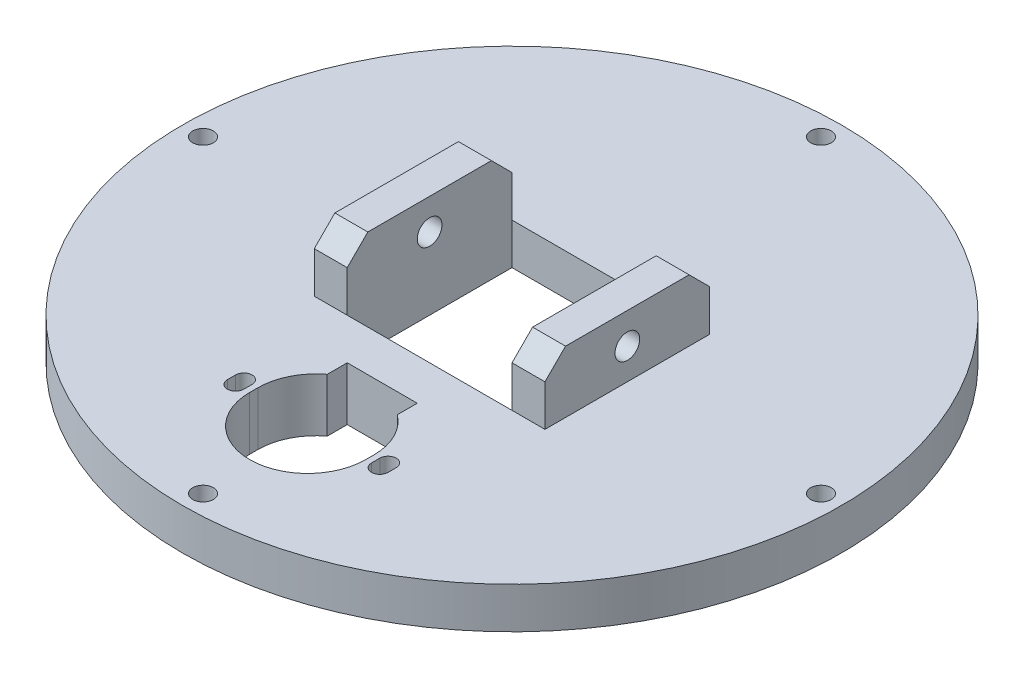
ISO-10303-21;
HEADER;
FILE_DESCRIPTION(('STEP AP214'),'2;1');
FILE_NAME('part.step','',(''),(''),'','','');
FILE_SCHEMA(('AUTOMOTIVE_DESIGN { 1 0 10303 214 1 1 1 1 }'));
ENDSEC;
DATA;
#1=APPLICATION_CONTEXT('core data for automotive mechanical design processes');
#2=APPLICATION_PROTOCOL_DEFINITION('international standard','automotive_design',2000,#1);
#3=PRODUCT_CONTEXT('',#1,'mechanical');
#4=PRODUCT('Part','Part','',(#3));
#5=PRODUCT_RELATED_PRODUCT_CATEGORY('part','',(#4));
#6=PRODUCT_DEFINITION_FORMATION('','',#4);
#7=PRODUCT_DEFINITION_CONTEXT('part definition',#1,'design');
#8=PRODUCT_DEFINITION('design','',#6,#7);
#9=PRODUCT_DEFINITION_SHAPE('','',#8);
#10=(LENGTH_UNIT() NAMED_UNIT(*) SI_UNIT(.MILLI.,.METRE.));
#11=(NAMED_UNIT(*) PLANE_ANGLE_UNIT() SI_UNIT($,.RADIAN.));
#12=(NAMED_UNIT(*) SI_UNIT($,.STERADIAN.) SOLID_ANGLE_UNIT());
#13=UNCERTAINTY_MEASURE_WITH_UNIT(LENGTH_MEASURE(1.E-05),#10,'distance_accuracy_value','');
#14=(GEOMETRIC_REPRESENTATION_CONTEXT(3) GLOBAL_UNCERTAINTY_ASSIGNED_CONTEXT((#13)) GLOBAL_UNIT_ASSIGNED_CONTEXT((#10,
#11,#12)) REPRESENTATION_CONTEXT('',''));
#15=CARTESIAN_POINT('',(0.,0.,0.));
#16=DIRECTION('',(0.,0.,1.));
#17=DIRECTION('',(1.,0.,0.));
#18=AXIS2_PLACEMENT_3D('',#15,#16,#17);
#19=CARTESIAN_POINT('',(0.,0.,0.));
#20=DIRECTION('',(0.,1.,0.));
#21=DIRECTION('',(0.,0.,1.));
#22=AXIS2_PLACEMENT_3D('',#19,#20,#21);
#23=PLANE('',#22);
#24=DIRECTION('',(1.,0.,0.));
#25=VECTOR('',#24,1.);
#26=CARTESIAN_POINT('',(-20.,0.,-20.));
#27=LINE('',#26,#25);
#28=CARTESIAN_POINT('',(-20.,0.,-20.));
#29=VERTEX_POINT('',#28);
#30=CARTESIAN_POINT('',(20.,0.,-20.));
#31=VERTEX_POINT('',#30);
#32=EDGE_CURVE('E529',#29,#31,#27,.T.);
#33=ORIENTED_EDGE('',*,*,#32,.F.);
#34=DIRECTION('',(0.,0.,-1.));
#35=VECTOR('',#34,1.);
#36=CARTESIAN_POINT('',(-20.,0.,-20.));
#37=LINE('',#36,#35);
#38=CARTESIAN_POINT('',(-20.,0.,20.));
#39=VERTEX_POINT('',#38);
#40=EDGE_CURVE('E532',#39,#29,#37,.T.);
#41=ORIENTED_EDGE('',*,*,#40,.F.);
#42=DIRECTION('',(-1.,0.,0.));
#43=VECTOR('',#42,1.);
#44=CARTESIAN_POINT('',(-20.,0.,20.));
#45=LINE('',#44,#43);
#46=CARTESIAN_POINT('',(20.,0.,20.));
#47=VERTEX_POINT('',#46);
#48=EDGE_CURVE('E545',#47,#39,#45,.T.);
#49=ORIENTED_EDGE('',*,*,#48,.F.);
#50=DIRECTION('',(0.,0.,1.));
#51=VECTOR('',#50,1.);
#52=CARTESIAN_POINT('',(20.,0.,-20.));
#53=LINE('',#52,#51);
#54=EDGE_CURVE('E474',#31,#47,#53,.T.);
#55=ORIENTED_EDGE('',*,*,#54,.F.);
#56=EDGE_LOOP('',(#33,#41,#49,#55));
#57=FACE_BOUND('',#56,.T.);
#58=CARTESIAN_POINT('',(-75.,0.,0.));
#59=DIRECTION('',(0.,1.,0.));
#60=DIRECTION('',(0.,0.,1.));
#61=AXIS2_PLACEMENT_3D('',#58,#59,#60);
#62=CIRCLE('',#61,2.5);
#63=CARTESIAN_POINT('',(-75.,0.,2.5));
#64=VERTEX_POINT('',#63);
#65=EDGE_CURVE('E560',#64,#64,#62,.F.);
#66=ORIENTED_EDGE('',*,*,#65,.F.);
#67=EDGE_LOOP('',(#66));
#68=FACE_BOUND('',#67,.T.);
#69=CARTESIAN_POINT('',(0.,0.,-75.));
#70=DIRECTION('',(0.,1.,0.));
#71=DIRECTION('',(0.,0.,1.));
#72=AXIS2_PLACEMENT_3D('',#69,#70,#71);
#73=CIRCLE('',#72,2.5);
#74=CARTESIAN_POINT('',(0.,0.,-72.5));
#75=VERTEX_POINT('',#74);
#76=EDGE_CURVE('E561',#75,#75,#73,.F.);
#77=ORIENTED_EDGE('',*,*,#76,.F.);
#78=EDGE_LOOP('',(#77));
#79=FACE_BOUND('',#78,.T.);
#80=CARTESIAN_POINT('',(75.,0.,0.));
#81=DIRECTION('',(0.,1.,0.));
#82=DIRECTION('',(0.,0.,1.));
#83=AXIS2_PLACEMENT_3D('',#80,#81,#82);
#84=CIRCLE('',#83,2.5);
#85=CARTESIAN_POINT('',(75.,0.,2.5));
#86=VERTEX_POINT('',#85);
#87=EDGE_CURVE('E568',#86,#86,#84,.F.);
#88=ORIENTED_EDGE('',*,*,#87,.F.);
#89=EDGE_LOOP('',(#88));
#90=FACE_BOUND('',#89,.T.);
#91=CARTESIAN_POINT('',(0.,0.,75.));
#92=DIRECTION('',(0.,1.,0.));
#93=DIRECTION('',(0.,0.,1.));
#94=AXIS2_PLACEMENT_3D('',#91,#92,#93);
#95=CIRCLE('',#94,2.5);
#96=CARTESIAN_POINT('',(0.,0.,77.5));
#97=VERTEX_POINT('',#96);
#98=EDGE_CURVE('E574',#97,#97,#95,.F.);
#99=ORIENTED_EDGE('',*,*,#98,.F.);
#100=EDGE_LOOP('',(#99));
#101=FACE_BOUND('',#100,.T.);
#102=CARTESIAN_POINT('',(0.,0.,0.));
#103=DIRECTION('',(0.,1.,0.));
#104=DIRECTION('',(0.,0.,1.));
#105=AXIS2_PLACEMENT_3D('',#102,#103,#104);
#106=CIRCLE('',#105,80.);
#107=CARTESIAN_POINT('',(0.,0.,80.));
#108=VERTEX_POINT('',#107);
#109=EDGE_CURVE('E564',#108,#108,#106,.T.);
#110=ORIENTED_EDGE('',*,*,#109,.F.);
#111=EDGE_LOOP('',(#110));
#112=FACE_BOUND('',#111,.T.);
#113=DIRECTION('',(1.,0.,0.));
#114=VECTOR('',#113,1.);
#115=CARTESIAN_POINT('',(0.,0.,25.));
#116=LINE('',#115,#114);
#117=CARTESIAN_POINT('',(-16.5,0.,25.));
#118=VERTEX_POINT('',#117);
#119=CARTESIAN_POINT('',(13.5,0.,25.));
#120=VERTEX_POINT('',#119);
#121=EDGE_CURVE('E389',#118,#120,#116,.T.);
#122=ORIENTED_EDGE('',*,*,#121,.F.);
#123=CARTESIAN_POINT('',(-16.5,0.,35.));
#124=DIRECTION('',(0.,1.,0.));
#125=DIRECTION('',(0.,0.,1.));
#126=AXIS2_PLACEMENT_3D('',#123,#124,#125);
#127=CIRCLE('',#126,10.);
#128=CARTESIAN_POINT('',(-26.5,0.,35.));
#129=VERTEX_POINT('',#128);
#130=EDGE_CURVE('E649',#118,#129,#127,.T.);
#131=ORIENTED_EDGE('',*,*,#130,.T.);
#132=DIRECTION('',(0.,0.,-1.));
#133=VECTOR('',#132,1.);
#134=CARTESIAN_POINT('',(-26.5,0.,0.));
#135=LINE('',#134,#133);
#136=CARTESIAN_POINT('',(-26.5,0.,55.));
#137=VERTEX_POINT('',#136);
#138=EDGE_CURVE('E332',#137,#129,#135,.T.);
#139=ORIENTED_EDGE('',*,*,#138,.F.);
#140=CARTESIAN_POINT('',(-16.5,0.,55.));
#141=DIRECTION('',(0.,1.,0.));
#142=DIRECTION('',(0.,0.,1.));
#143=AXIS2_PLACEMENT_3D('',#140,#141,#142);
#144=CIRCLE('',#143,10.);
#145=CARTESIAN_POINT('',(-16.5,0.,65.));
#146=VERTEX_POINT('',#145);
#147=EDGE_CURVE('E13',#137,#146,#144,.T.);
#148=ORIENTED_EDGE('',*,*,#147,.T.);
#149=DIRECTION('',(1.,0.,0.));
#150=VECTOR('',#149,1.);
#151=CARTESIAN_POINT('',(0.,0.,65.));
#152=LINE('',#151,#150);
#153=CARTESIAN_POINT('',(13.5,0.,65.));
#154=VERTEX_POINT('',#153);
#155=EDGE_CURVE('E335',#146,#154,#152,.T.);
#156=ORIENTED_EDGE('',*,*,#155,.T.);
#157=CARTESIAN_POINT('',(13.5,0.,55.));
#158=DIRECTION('',(0.,1.,0.));
#159=DIRECTION('',(0.,0.,1.));
#160=AXIS2_PLACEMENT_3D('',#157,#158,#159);
#161=CIRCLE('',#160,10.);
#162=CARTESIAN_POINT('',(23.5,0.,55.));
#163=VERTEX_POINT('',#162);
#164=EDGE_CURVE('E70',#154,#163,#161,.T.);
#165=ORIENTED_EDGE('',*,*,#164,.T.);
#166=DIRECTION('',(0.,0.,-1.));
#167=VECTOR('',#166,1.);
#168=CARTESIAN_POINT('',(23.5,0.,0.));
#169=LINE('',#168,#167);
#170=CARTESIAN_POINT('',(23.5,0.,35.));
#171=VERTEX_POINT('',#170);
#172=EDGE_CURVE('E392',#163,#171,#169,.T.);
#173=ORIENTED_EDGE('',*,*,#172,.T.);
#174=CARTESIAN_POINT('',(13.5,0.,35.));
#175=DIRECTION('',(0.,1.,0.));
#176=DIRECTION('',(0.,0.,1.));
#177=AXIS2_PLACEMENT_3D('',#174,#175,#176);
#178=CIRCLE('',#177,10.);
#179=EDGE_CURVE('E651',#171,#120,#178,.T.);
#180=ORIENTED_EDGE('',*,*,#179,.T.);
#181=EDGE_LOOP('',(#122,#131,#139,#148,#156,#165,#173,#180));
#182=FACE_BOUND('',#181,.T.);
#183=ADVANCED_FACE('F62',(#57,#68,#79,#90,#101,#112,#182),#23,.F.);
#184=CARTESIAN_POINT('',(0.,10.,0.));
#185=DIRECTION('',(0.,1.,0.));
#186=DIRECTION('',(0.,0.,1.));
#187=AXIS2_PLACEMENT_3D('',#184,#185,#186);
#188=PLANE('',#187);
#189=DIRECTION('',(-1.,0.,0.));
#190=VECTOR('',#189,1.);
#191=CARTESIAN_POINT('',(20.,10.,20.));
#192=LINE('',#191,#190);
#193=CARTESIAN_POINT('',(28.,10.,20.));
#194=VERTEX_POINT('',#193);
#195=CARTESIAN_POINT('',(20.,10.,20.));
#196=VERTEX_POINT('',#195);
#197=EDGE_CURVE('E399',#194,#196,#192,.T.);
#198=ORIENTED_EDGE('',*,*,#197,.T.);
#199=DIRECTION('',(1.,0.,0.));
#200=VECTOR('',#199,1.);
#201=CARTESIAN_POINT('',(-20.,10.,20.));
#202=LINE('',#201,#200);
#203=CARTESIAN_POINT('',(-20.,10.,20.));
#204=VERTEX_POINT('',#203);
#205=EDGE_CURVE('E535',#204,#196,#202,.T.);
#206=ORIENTED_EDGE('',*,*,#205,.F.);
#207=DIRECTION('',(1.,0.,0.));
#208=VECTOR('',#207,1.);
#209=CARTESIAN_POINT('',(-20.,10.,20.));
#210=LINE('',#209,#208);
#211=CARTESIAN_POINT('',(-28.,10.,20.));
#212=VERTEX_POINT('',#211);
#213=EDGE_CURVE('E435',#212,#204,#210,.T.);
#214=ORIENTED_EDGE('',*,*,#213,.F.);
#215=DIRECTION('',(0.,0.,1.));
#216=VECTOR('',#215,1.);
#217=CARTESIAN_POINT('',(-28.,10.,-20.));
#218=LINE('',#217,#216);
#219=CARTESIAN_POINT('',(-28.,10.,-20.));
#220=VERTEX_POINT('',#219);
#221=EDGE_CURVE('E441',#220,#212,#218,.T.);
#222=ORIENTED_EDGE('',*,*,#221,.F.);
#223=DIRECTION('',(-1.,0.,0.));
#224=VECTOR('',#223,1.);
#225=CARTESIAN_POINT('',(-20.,10.,-20.));
#226=LINE('',#225,#224);
#227=CARTESIAN_POINT('',(-20.,10.,-20.));
#228=VERTEX_POINT('',#227);
#229=EDGE_CURVE('E430',#228,#220,#226,.T.);
#230=ORIENTED_EDGE('',*,*,#229,.F.);
#231=DIRECTION('',(-1.,0.,0.));
#232=VECTOR('',#231,1.);
#233=CARTESIAN_POINT('',(-20.,10.,-20.));
#234=LINE('',#233,#232);
#235=CARTESIAN_POINT('',(20.,10.,-20.));
#236=VERTEX_POINT('',#235);
#237=EDGE_CURVE('E538',#236,#228,#234,.T.);
#238=ORIENTED_EDGE('',*,*,#237,.F.);
#239=DIRECTION('',(1.,0.,0.));
#240=VECTOR('',#239,1.);
#241=CARTESIAN_POINT('',(20.,10.,-20.));
#242=LINE('',#241,#240);
#243=CARTESIAN_POINT('',(28.,10.,-20.));
#244=VERTEX_POINT('',#243);
#245=EDGE_CURVE('E406',#236,#244,#242,.T.);
#246=ORIENTED_EDGE('',*,*,#245,.T.);
#247=DIRECTION('',(0.,0.,1.));
#248=VECTOR('',#247,1.);
#249=CARTESIAN_POINT('',(28.,10.,-20.));
#250=LINE('',#249,#248);
#251=EDGE_CURVE('E412',#244,#194,#250,.T.);
#252=ORIENTED_EDGE('',*,*,#251,.T.);
#253=EDGE_LOOP('',(#198,#206,#214,#222,#230,#238,#246,#252));
#254=FACE_BOUND('',#253,.T.);
#255=CARTESIAN_POINT('',(16.,10.,46.1));
#256=DIRECTION('',(0.,1.,0.));
#257=DIRECTION('',(0.,0.,1.));
#258=AXIS2_PLACEMENT_3D('',#255,#256,#257);
#259=CIRCLE('',#258,2.);
#260=CARTESIAN_POINT('',(18.,10.,46.1));
#261=VERTEX_POINT('',#260);
#262=CARTESIAN_POINT('',(14.,10.,46.1));
#263=VERTEX_POINT('',#262);
#264=EDGE_CURVE('E312',#261,#263,#259,.T.);
#265=ORIENTED_EDGE('',*,*,#264,.F.);
#266=DIRECTION('',(0.,0.,1.));
#267=VECTOR('',#266,1.);
#268=CARTESIAN_POINT('',(18.,10.,46.1));
#269=LINE('',#268,#267);
#270=CARTESIAN_POINT('',(18.,10.,48.1));
#271=VERTEX_POINT('',#270);
#272=EDGE_CURVE('E316',#261,#271,#269,.T.);
#273=ORIENTED_EDGE('',*,*,#272,.T.);
#274=CARTESIAN_POINT('',(16.,10.,48.1));
#275=DIRECTION('',(0.,1.,0.));
#276=DIRECTION('',(0.,0.,1.));
#277=AXIS2_PLACEMENT_3D('',#274,#275,#276);
#278=CIRCLE('',#277,2.);
#279=CARTESIAN_POINT('',(14.,10.,48.1));
#280=VERTEX_POINT('',#279);
#281=EDGE_CURVE('E484',#280,#271,#278,.T.);
#282=ORIENTED_EDGE('',*,*,#281,.F.);
#283=DIRECTION('',(0.,0.,1.));
#284=VECTOR('',#283,1.);
#285=CARTESIAN_POINT('',(14.,10.,46.1));
#286=LINE('',#285,#284);
#287=EDGE_CURVE('E487',#263,#280,#286,.T.);
#288=ORIENTED_EDGE('',*,*,#287,.F.);
#289=EDGE_LOOP('',(#265,#273,#282,#288));
#290=FACE_BOUND('',#289,.T.);
#291=CARTESIAN_POINT('',(-1.5,10.,48.1));
#292=DIRECTION('',(0.,1.,0.));
#293=DIRECTION('',(0.,0.,1.));
#294=AXIS2_PLACEMENT_3D('',#291,#292,#293);
#295=CIRCLE('',#294,14.1);
#296=CARTESIAN_POINT('',(-15.6,10.,48.1));
#297=VERTEX_POINT('',#296);
#298=CARTESIAN_POINT('',(12.6,10.,48.1));
#299=VERTEX_POINT('',#298);
#300=EDGE_CURVE('E503',#297,#299,#295,.T.);
#301=ORIENTED_EDGE('',*,*,#300,.F.);
#302=DIRECTION('',(0.,0.,1.));
#303=VECTOR('',#302,1.);
#304=CARTESIAN_POINT('',(-15.6,10.,46.1));
#305=LINE('',#304,#303);
#306=CARTESIAN_POINT('',(-15.6,10.,46.1));
#307=VERTEX_POINT('',#306);
#308=EDGE_CURVE('E506',#307,#297,#305,.T.);
#309=ORIENTED_EDGE('',*,*,#308,.F.);
#310=CARTESIAN_POINT('',(-1.5,10.,46.1));
#311=DIRECTION('',(0.,1.,0.));
#312=DIRECTION('',(0.,0.,1.));
#313=AXIS2_PLACEMENT_3D('',#310,#311,#312);
#314=CIRCLE('',#313,14.1);
#315=CARTESIAN_POINT('',(-10.,10.,34.8501111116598));
#316=VERTEX_POINT('',#315);
#317=EDGE_CURVE('E481',#316,#307,#314,.T.);
#318=ORIENTED_EDGE('',*,*,#317,.F.);
#319=DIRECTION('',(0.,0.,-1.));
#320=VECTOR('',#319,1.);
#321=CARTESIAN_POINT('',(-10.,10.,34.8501111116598));
#322=LINE('',#321,#320);
#323=CARTESIAN_POINT('',(-10.,10.,30.));
#324=VERTEX_POINT('',#323);
#325=EDGE_CURVE('E523',#316,#324,#322,.T.);
#326=ORIENTED_EDGE('',*,*,#325,.T.);
#327=DIRECTION('',(-1.,0.,0.));
#328=VECTOR('',#327,1.);
#329=CARTESIAN_POINT('',(7.,10.,30.));
#330=LINE('',#329,#328);
#331=CARTESIAN_POINT('',(7.,10.,30.));
#332=VERTEX_POINT('',#331);
#333=EDGE_CURVE('E500',#332,#324,#330,.T.);
#334=ORIENTED_EDGE('',*,*,#333,.F.);
#335=DIRECTION('',(0.,0.,-1.));
#336=VECTOR('',#335,1.);
#337=CARTESIAN_POINT('',(7.,10.,34.8501111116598));
#338=LINE('',#337,#336);
#339=CARTESIAN_POINT('',(7.,10.,34.8501111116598));
#340=VERTEX_POINT('',#339);
#341=EDGE_CURVE('E514',#340,#332,#338,.T.);
#342=ORIENTED_EDGE('',*,*,#341,.F.);
#343=CARTESIAN_POINT('',(12.6,10.,46.1));
#344=VERTEX_POINT('',#343);
#345=EDGE_CURVE('E509',#344,#340,#314,.T.);
#346=ORIENTED_EDGE('',*,*,#345,.F.);
#347=DIRECTION('',(0.,0.,1.));
#348=VECTOR('',#347,1.);
#349=CARTESIAN_POINT('',(12.6,10.,46.1));
#350=LINE('',#349,#348);
#351=EDGE_CURVE('E493',#344,#299,#350,.T.);
#352=ORIENTED_EDGE('',*,*,#351,.T.);
#353=EDGE_LOOP('',(#301,#309,#318,#326,#334,#342,#346,#352));
#354=FACE_BOUND('',#353,.T.);
#355=CARTESIAN_POINT('',(-75.,10.,0.));
#356=DIRECTION('',(0.,1.,0.));
#357=DIRECTION('',(0.,0.,1.));
#358=AXIS2_PLACEMENT_3D('',#355,#356,#357);
#359=CIRCLE('',#358,2.5);
#360=CARTESIAN_POINT('',(-75.,10.,2.5));
#361=VERTEX_POINT('',#360);
#362=EDGE_CURVE('E557',#361,#361,#359,.T.);
#363=ORIENTED_EDGE('',*,*,#362,.F.);
#364=EDGE_LOOP('',(#363));
#365=FACE_BOUND('',#364,.T.);
#366=CARTESIAN_POINT('',(0.,10.,-75.));
#367=DIRECTION('',(0.,1.,0.));
#368=DIRECTION('',(0.,0.,1.));
#369=AXIS2_PLACEMENT_3D('',#366,#367,#368);
#370=CIRCLE('',#369,2.5);
#371=CARTESIAN_POINT('',(0.,10.,-72.5));
#372=VERTEX_POINT('',#371);
#373=EDGE_CURVE('E565',#372,#372,#370,.T.);
#374=ORIENTED_EDGE('',*,*,#373,.F.);
#375=EDGE_LOOP('',(#374));
#376=FACE_BOUND('',#375,.T.);
#377=CARTESIAN_POINT('',(75.,10.,0.));
#378=DIRECTION('',(0.,1.,0.));
#379=DIRECTION('',(0.,0.,1.));
#380=AXIS2_PLACEMENT_3D('',#377,#378,#379);
#381=CIRCLE('',#380,2.5);
#382=CARTESIAN_POINT('',(75.,10.,2.5));
#383=VERTEX_POINT('',#382);
#384=EDGE_CURVE('E571',#383,#383,#381,.T.);
#385=ORIENTED_EDGE('',*,*,#384,.F.);
#386=EDGE_LOOP('',(#385));
#387=FACE_BOUND('',#386,.T.);
#388=CARTESIAN_POINT('',(0.,10.,75.));
#389=DIRECTION('',(0.,1.,0.));
#390=DIRECTION('',(0.,0.,1.));
#391=AXIS2_PLACEMENT_3D('',#388,#389,#390);
#392=CIRCLE('',#391,2.5);
#393=CARTESIAN_POINT('',(0.,10.,77.5));
#394=VERTEX_POINT('',#393);
#395=EDGE_CURVE('E556',#394,#394,#392,.T.);
#396=ORIENTED_EDGE('',*,*,#395,.F.);
#397=EDGE_LOOP('',(#396));
#398=FACE_BOUND('',#397,.T.);
#399=CARTESIAN_POINT('',(0.,10.,0.));
#400=DIRECTION('',(0.,1.,0.));
#401=DIRECTION('',(0.,0.,1.));
#402=AXIS2_PLACEMENT_3D('',#399,#400,#401);
#403=CIRCLE('',#402,80.);
#404=CARTESIAN_POINT('',(0.,10.,80.));
#405=VERTEX_POINT('',#404);
#406=EDGE_CURVE('E581',#405,#405,#403,.T.);
#407=ORIENTED_EDGE('',*,*,#406,.T.);
#408=EDGE_LOOP('',(#407));
#409=FACE_BOUND('',#408,.T.);
#410=DIRECTION('',(0.,0.,1.));
#411=VECTOR('',#410,1.);
#412=CARTESIAN_POINT('',(-21.,10.,46.1));
#413=LINE('',#412,#411);
#414=CARTESIAN_POINT('',(-21.,10.,46.1));
#415=VERTEX_POINT('',#414);
#416=CARTESIAN_POINT('',(-21.,10.,48.1));
#417=VERTEX_POINT('',#416);
#418=EDGE_CURVE('E463',#415,#417,#413,.T.);
#419=ORIENTED_EDGE('',*,*,#418,.F.);
#420=CARTESIAN_POINT('',(-19.,10.,46.1));
#421=DIRECTION('',(0.,-1.,0.));
#422=DIRECTION('',(0.,0.,-1.));
#423=AXIS2_PLACEMENT_3D('',#420,#421,#422);
#424=CIRCLE('',#423,2.);
#425=CARTESIAN_POINT('',(-17.,10.,46.1));
#426=VERTEX_POINT('',#425);
#427=EDGE_CURVE('E454',#415,#426,#424,.T.);
#428=ORIENTED_EDGE('',*,*,#427,.T.);
#429=DIRECTION('',(0.,0.,1.));
#430=VECTOR('',#429,1.);
#431=CARTESIAN_POINT('',(-17.,10.,46.1));
#432=LINE('',#431,#430);
#433=CARTESIAN_POINT('',(-17.,10.,48.1));
#434=VERTEX_POINT('',#433);
#435=EDGE_CURVE('E457',#426,#434,#432,.T.);
#436=ORIENTED_EDGE('',*,*,#435,.T.);
#437=CARTESIAN_POINT('',(-19.,10.,48.1));
#438=DIRECTION('',(0.,-1.,0.));
#439=DIRECTION('',(0.,0.,-1.));
#440=AXIS2_PLACEMENT_3D('',#437,#438,#439);
#441=CIRCLE('',#440,2.);
#442=EDGE_CURVE('E460',#434,#417,#441,.T.);
#443=ORIENTED_EDGE('',*,*,#442,.T.);
#444=EDGE_LOOP('',(#419,#428,#436,#443));
#445=FACE_BOUND('',#444,.T.);
#446=ADVANCED_FACE('F691',(#254,#290,#354,#365,#376,#387,#398,#409,#445),#188,.T.);
#447=CARTESIAN_POINT('',(0.,10.,0.));
#448=DIRECTION('',(0.,-1.,0.));
#449=DIRECTION('',(0.,0.,-1.));
#450=AXIS2_PLACEMENT_3D('',#447,#448,#449);
#451=CYLINDRICAL_SURFACE('',#450,80.);
#452=ORIENTED_EDGE('',*,*,#406,.F.);
#453=EDGE_LOOP('',(#452));
#454=FACE_BOUND('',#453,.T.);
#455=ORIENTED_EDGE('',*,*,#109,.T.);
#456=EDGE_LOOP('',(#455));
#457=FACE_BOUND('',#456,.T.);
#458=ADVANCED_FACE('F697',(#454,#457),#451,.T.);
#459=CARTESIAN_POINT('',(0.,-0.000999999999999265,75.));
#460=DIRECTION('',(0.,1.,0.));
#461=DIRECTION('',(0.,0.,1.));
#462=AXIS2_PLACEMENT_3D('',#459,#460,#461);
#463=CYLINDRICAL_SURFACE('',#462,2.5);
#464=ORIENTED_EDGE('',*,*,#395,.T.);
#465=EDGE_LOOP('',(#464));
#466=FACE_BOUND('',#465,.T.);
#467=ORIENTED_EDGE('',*,*,#98,.T.);
#468=EDGE_LOOP('',(#467));
#469=FACE_BOUND('',#468,.T.);
#470=ADVANCED_FACE('F706',(#466,#469),#463,.F.);
#471=CARTESIAN_POINT('',(75.,-0.000999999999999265,0.));
#472=DIRECTION('',(0.,1.,0.));
#473=DIRECTION('',(0.,0.,1.));
#474=AXIS2_PLACEMENT_3D('',#471,#472,#473);
#475=CYLINDRICAL_SURFACE('',#474,2.5);
#476=ORIENTED_EDGE('',*,*,#384,.T.);
#477=EDGE_LOOP('',(#476));
#478=FACE_BOUND('',#477,.T.);
#479=ORIENTED_EDGE('',*,*,#87,.T.);
#480=EDGE_LOOP('',(#479));
#481=FACE_BOUND('',#480,.T.);
#482=ADVANCED_FACE('F814',(#478,#481),#475,.F.);
#483=CARTESIAN_POINT('',(0.,-0.000999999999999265,-75.));
#484=DIRECTION('',(0.,1.,0.));
#485=DIRECTION('',(0.,0.,1.));
#486=AXIS2_PLACEMENT_3D('',#483,#484,#485);
#487=CYLINDRICAL_SURFACE('',#486,2.5);
#488=ORIENTED_EDGE('',*,*,#373,.T.);
#489=EDGE_LOOP('',(#488));
#490=FACE_BOUND('',#489,.T.);
#491=ORIENTED_EDGE('',*,*,#76,.T.);
#492=EDGE_LOOP('',(#491));
#493=FACE_BOUND('',#492,.T.);
#494=ADVANCED_FACE('F810',(#490,#493),#487,.F.);
#495=CARTESIAN_POINT('',(-75.,-0.000999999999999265,0.));
#496=DIRECTION('',(0.,1.,0.));
#497=DIRECTION('',(0.,0.,1.));
#498=AXIS2_PLACEMENT_3D('',#495,#496,#497);
#499=CYLINDRICAL_SURFACE('',#498,2.5);
#500=ORIENTED_EDGE('',*,*,#362,.T.);
#501=EDGE_LOOP('',(#500));
#502=FACE_BOUND('',#501,.T.);
#503=ORIENTED_EDGE('',*,*,#65,.T.);
#504=EDGE_LOOP('',(#503));
#505=FACE_BOUND('',#504,.T.);
#506=ADVANCED_FACE('F799',(#502,#505),#499,.F.);
#507=CARTESIAN_POINT('',(-20.,-0.000999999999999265,-20.));
#508=DIRECTION('',(-1.,0.,0.));
#509=DIRECTION('',(0.,0.,1.));
#510=AXIS2_PLACEMENT_3D('',#507,#508,#509);
#511=PLANE('',#510);
#512=CARTESIAN_POINT('',(-20.,17.5,0.));
#513=DIRECTION('',(-1.,0.,0.));
#514=DIRECTION('',(0.,0.,1.));
#515=AXIS2_PLACEMENT_3D('',#512,#513,#514);
#516=CIRCLE('',#515,3.);
#517=CARTESIAN_POINT('',(-20.,17.5,3.00000000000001));
#518=VERTEX_POINT('',#517);
#519=EDGE_CURVE('E427',#518,#518,#516,.F.);
#520=ORIENTED_EDGE('',*,*,#519,.F.);
#521=EDGE_LOOP('',(#520));
#522=FACE_BOUND('',#521,.T.);
#523=DIRECTION('',(0.,-1.,0.));
#524=VECTOR('',#523,1.);
#525=CARTESIAN_POINT('',(-20.,25.,-20.));
#526=LINE('',#525,#524);
#527=CARTESIAN_POINT('',(-20.,20.,-20.));
#528=VERTEX_POINT('',#527);
#529=EDGE_CURVE('E451',#528,#228,#526,.T.);
#530=ORIENTED_EDGE('',*,*,#529,.F.);
#531=DIRECTION('',(0.,-0.707106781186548,-0.707106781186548));
#532=VECTOR('',#531,1.);
#533=CARTESIAN_POINT('',(-20.,25.,-15.));
#534=LINE('',#533,#532);
#535=CARTESIAN_POINT('',(-20.,25.,-15.));
#536=VERTEX_POINT('',#535);
#537=EDGE_CURVE('E600',#528,#536,#534,.F.);
#538=ORIENTED_EDGE('',*,*,#537,.T.);
#539=DIRECTION('',(0.,0.,-1.));
#540=VECTOR('',#539,1.);
#541=CARTESIAN_POINT('',(-20.,25.,-20.));
#542=LINE('',#541,#540);
#543=CARTESIAN_POINT('',(-20.,25.,15.));
#544=VERTEX_POINT('',#543);
#545=EDGE_CURVE('E431',#544,#536,#542,.T.);
#546=ORIENTED_EDGE('',*,*,#545,.F.);
#547=DIRECTION('',(0.,0.707106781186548,-0.707106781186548));
#548=VECTOR('',#547,1.);
#549=CARTESIAN_POINT('',(-20.,25.,15.));
#550=LINE('',#549,#548);
#551=CARTESIAN_POINT('',(-20.,20.,20.));
#552=VERTEX_POINT('',#551);
#553=EDGE_CURVE('E598',#544,#552,#550,.F.);
#554=ORIENTED_EDGE('',*,*,#553,.T.);
#555=DIRECTION('',(0.,-1.,0.));
#556=VECTOR('',#555,1.);
#557=CARTESIAN_POINT('',(-20.,25.,20.));
#558=LINE('',#557,#556);
#559=EDGE_CURVE('E438',#552,#204,#558,.T.);
#560=ORIENTED_EDGE('',*,*,#559,.T.);
#561=DIRECTION('',(0.,1.,0.));
#562=VECTOR('',#561,1.);
#563=CARTESIAN_POINT('',(-20.,-0.000999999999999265,20.));
#564=LINE('',#563,#562);
#565=EDGE_CURVE('E541',#39,#204,#564,.T.);
#566=ORIENTED_EDGE('',*,*,#565,.F.);
#567=ORIENTED_EDGE('',*,*,#40,.T.);
#568=DIRECTION('',(0.,1.,0.));
#569=VECTOR('',#568,1.);
#570=CARTESIAN_POINT('',(-20.,-0.000999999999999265,-20.));
#571=LINE('',#570,#569);
#572=EDGE_CURVE('E542',#29,#228,#571,.T.);
#573=ORIENTED_EDGE('',*,*,#572,.T.);
#574=EDGE_LOOP('',(#530,#538,#546,#554,#560,#566,#567,#573));
#575=FACE_BOUND('',#574,.T.);
#576=ADVANCED_FACE('F781',(#522,#575),#511,.F.);
#577=CARTESIAN_POINT('',(-20.,-0.000999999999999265,-20.));
#578=DIRECTION('',(0.,0.,-1.));
#579=DIRECTION('',(-1.,0.,0.));
#580=AXIS2_PLACEMENT_3D('',#577,#578,#579);
#581=PLANE('',#580);
#582=ORIENTED_EDGE('',*,*,#32,.T.);
#583=DIRECTION('',(0.,1.,0.));
#584=VECTOR('',#583,1.);
#585=CARTESIAN_POINT('',(20.,-0.000999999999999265,-20.));
#586=LINE('',#585,#584);
#587=EDGE_CURVE('E546',#31,#236,#586,.T.);
#588=ORIENTED_EDGE('',*,*,#587,.T.);
#589=ORIENTED_EDGE('',*,*,#237,.T.);
#590=ORIENTED_EDGE('',*,*,#572,.F.);
#591=EDGE_LOOP('',(#582,#588,#589,#590));
#592=FACE_BOUND('',#591,.T.);
#593=ADVANCED_FACE('F790',(#592),#581,.F.);
#594=CARTESIAN_POINT('',(20.,-0.000999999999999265,-20.));
#595=DIRECTION('',(1.,0.,0.));
#596=DIRECTION('',(0.,0.,-1.));
#597=AXIS2_PLACEMENT_3D('',#594,#595,#596);
#598=PLANE('',#597);
#599=CARTESIAN_POINT('',(20.,17.5,0.));
#600=DIRECTION('',(1.,0.,0.));
#601=DIRECTION('',(0.,0.,-1.));
#602=AXIS2_PLACEMENT_3D('',#599,#600,#601);
#603=CIRCLE('',#602,3.);
#604=CARTESIAN_POINT('',(20.,17.5,-3.));
#605=VERTEX_POINT('',#604);
#606=EDGE_CURVE('E388',#605,#605,#603,.T.);
#607=ORIENTED_EDGE('',*,*,#606,.T.);
#608=EDGE_LOOP('',(#607));
#609=FACE_BOUND('',#608,.T.);
#610=DIRECTION('',(0.,0.,-1.));
#611=VECTOR('',#610,1.);
#612=CARTESIAN_POINT('',(20.,25.,-20.));
#613=LINE('',#612,#611);
#614=CARTESIAN_POINT('',(20.,25.,15.));
#615=VERTEX_POINT('',#614);
#616=CARTESIAN_POINT('',(20.,25.,-15.));
#617=VERTEX_POINT('',#616);
#618=EDGE_CURVE('E402',#615,#617,#613,.T.);
#619=ORIENTED_EDGE('',*,*,#618,.T.);
#620=DIRECTION('',(0.,-0.707106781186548,-0.707106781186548));
#621=VECTOR('',#620,1.);
#622=CARTESIAN_POINT('',(20.,20.,-20.));
#623=LINE('',#622,#621);
#624=CARTESIAN_POINT('',(20.,20.,-20.));
#625=VERTEX_POINT('',#624);
#626=EDGE_CURVE('E617',#617,#625,#623,.T.);
#627=ORIENTED_EDGE('',*,*,#626,.T.);
#628=DIRECTION('',(0.,-1.,0.));
#629=VECTOR('',#628,1.);
#630=CARTESIAN_POINT('',(20.,25.,-20.));
#631=LINE('',#630,#629);
#632=EDGE_CURVE('E409',#625,#236,#631,.T.);
#633=ORIENTED_EDGE('',*,*,#632,.T.);
#634=ORIENTED_EDGE('',*,*,#587,.F.);
#635=ORIENTED_EDGE('',*,*,#54,.T.);
#636=DIRECTION('',(0.,1.,0.));
#637=VECTOR('',#636,1.);
#638=CARTESIAN_POINT('',(20.,-0.000999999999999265,20.));
#639=LINE('',#638,#637);
#640=EDGE_CURVE('E549',#47,#196,#639,.T.);
#641=ORIENTED_EDGE('',*,*,#640,.T.);
#642=DIRECTION('',(0.,-1.,0.));
#643=VECTOR('',#642,1.);
#644=CARTESIAN_POINT('',(20.,25.,20.));
#645=LINE('',#644,#643);
#646=CARTESIAN_POINT('',(20.,20.,20.));
#647=VERTEX_POINT('',#646);
#648=EDGE_CURVE('E422',#647,#196,#645,.T.);
#649=ORIENTED_EDGE('',*,*,#648,.F.);
#650=DIRECTION('',(0.,0.707106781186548,-0.707106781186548));
#651=VECTOR('',#650,1.);
#652=CARTESIAN_POINT('',(20.,20.,20.));
#653=LINE('',#652,#651);
#654=EDGE_CURVE('E615',#647,#615,#653,.T.);
#655=ORIENTED_EDGE('',*,*,#654,.T.);
#656=EDGE_LOOP('',(#619,#627,#633,#634,#635,#641,#649,#655));
#657=FACE_BOUND('',#656,.T.);
#658=ADVANCED_FACE('F758',(#609,#657),#598,.F.);
#659=CARTESIAN_POINT('',(-20.,-0.000999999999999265,20.));
#660=DIRECTION('',(0.,0.,1.));
#661=DIRECTION('',(1.,0.,0.));
#662=AXIS2_PLACEMENT_3D('',#659,#660,#661);
#663=PLANE('',#662);
#664=ORIENTED_EDGE('',*,*,#48,.T.);
#665=ORIENTED_EDGE('',*,*,#565,.T.);
#666=ORIENTED_EDGE('',*,*,#205,.T.);
#667=ORIENTED_EDGE('',*,*,#640,.F.);
#668=EDGE_LOOP('',(#664,#665,#666,#667));
#669=FACE_BOUND('',#668,.T.);
#670=ADVANCED_FACE('F763',(#669),#663,.F.);
#671=CARTESIAN_POINT('',(7.,-0.000999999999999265,34.8501111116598));
#672=DIRECTION('',(1.,0.,0.));
#673=DIRECTION('',(0.,0.,-1.));
#674=AXIS2_PLACEMENT_3D('',#671,#672,#673);
#675=PLANE('',#674);
#676=DIRECTION('',(0.,1.,0.));
#677=VECTOR('',#676,1.);
#678=CARTESIAN_POINT('',(7.,-0.000999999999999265,30.));
#679=LINE('',#678,#677);
#680=CARTESIAN_POINT('',(7.,-3.,30.));
#681=VERTEX_POINT('',#680);
#682=EDGE_CURVE('E453',#681,#332,#679,.T.);
#683=ORIENTED_EDGE('',*,*,#682,.F.);
#684=DIRECTION('',(0.,0.,-1.));
#685=VECTOR('',#684,1.);
#686=CARTESIAN_POINT('',(7.,-3.,0.));
#687=LINE('',#686,#685);
#688=CARTESIAN_POINT('',(7.,-3.,34.8501111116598));
#689=VERTEX_POINT('',#688);
#690=EDGE_CURVE('E373',#689,#681,#687,.T.);
#691=ORIENTED_EDGE('',*,*,#690,.F.);
#692=DIRECTION('',(0.,1.,0.));
#693=VECTOR('',#692,1.);
#694=CARTESIAN_POINT('',(7.,-0.000999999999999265,34.8501111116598));
#695=LINE('',#694,#693);
#696=EDGE_CURVE('E518',#689,#340,#695,.T.);
#697=ORIENTED_EDGE('',*,*,#696,.T.);
#698=ORIENTED_EDGE('',*,*,#341,.T.);
#699=EDGE_LOOP('',(#683,#691,#697,#698));
#700=FACE_BOUND('',#699,.T.);
#701=ADVANCED_FACE('F803',(#700),#675,.F.);
#702=CARTESIAN_POINT('',(7.,-0.000999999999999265,30.));
#703=DIRECTION('',(0.,0.,-1.));
#704=DIRECTION('',(-1.,0.,0.));
#705=AXIS2_PLACEMENT_3D('',#702,#703,#704);
#706=PLANE('',#705);
#707=DIRECTION('',(0.,1.,0.));
#708=VECTOR('',#707,1.);
#709=CARTESIAN_POINT('',(-10.,-0.000999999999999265,30.));
#710=LINE('',#709,#708);
#711=CARTESIAN_POINT('',(-10.,-3.,30.));
#712=VERTEX_POINT('',#711);
#713=EDGE_CURVE('E512',#712,#324,#710,.T.);
#714=ORIENTED_EDGE('',*,*,#713,.F.);
#715=DIRECTION('',(-1.,0.,0.));
#716=VECTOR('',#715,1.);
#717=CARTESIAN_POINT('',(0.,-3.,30.));
#718=LINE('',#717,#716);
#719=EDGE_CURVE('E376',#681,#712,#718,.T.);
#720=ORIENTED_EDGE('',*,*,#719,.F.);
#721=ORIENTED_EDGE('',*,*,#682,.T.);
#722=ORIENTED_EDGE('',*,*,#333,.T.);
#723=EDGE_LOOP('',(#714,#720,#721,#722));
#724=FACE_BOUND('',#723,.T.);
#725=ADVANCED_FACE('F891',(#724),#706,.F.);
#726=CARTESIAN_POINT('',(-10.,-0.000999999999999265,34.8501111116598));
#727=DIRECTION('',(1.,0.,0.));
#728=DIRECTION('',(0.,0.,-1.));
#729=AXIS2_PLACEMENT_3D('',#726,#727,#728);
#730=PLANE('',#729);
#731=ORIENTED_EDGE('',*,*,#713,.T.);
#732=ORIENTED_EDGE('',*,*,#325,.F.);
#733=DIRECTION('',(0.,1.,0.));
#734=VECTOR('',#733,1.);
#735=CARTESIAN_POINT('',(-10.,-0.000999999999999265,34.8501111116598));
#736=LINE('',#735,#734);
#737=CARTESIAN_POINT('',(-10.,-3.,34.8501111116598));
#738=VERTEX_POINT('',#737);
#739=EDGE_CURVE('E515',#738,#316,#736,.T.);
#740=ORIENTED_EDGE('',*,*,#739,.F.);
#741=DIRECTION('',(0.,0.,1.));
#742=VECTOR('',#741,1.);
#743=CARTESIAN_POINT('',(-10.,-3.,0.));
#744=LINE('',#743,#742);
#745=EDGE_CURVE('E379',#712,#738,#744,.T.);
#746=ORIENTED_EDGE('',*,*,#745,.F.);
#747=EDGE_LOOP('',(#731,#732,#740,#746));
#748=FACE_BOUND('',#747,.T.);
#749=ADVANCED_FACE('F880',(#748),#730,.T.);
#750=CARTESIAN_POINT('',(-15.6,-0.000999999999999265,46.1));
#751=DIRECTION('',(-1.,0.,0.));
#752=DIRECTION('',(0.,0.,1.));
#753=AXIS2_PLACEMENT_3D('',#750,#751,#752);
#754=PLANE('',#753);
#755=DIRECTION('',(0.,1.,0.));
#756=VECTOR('',#755,1.);
#757=CARTESIAN_POINT('',(-15.6,-0.000999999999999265,48.1));
#758=LINE('',#757,#756);
#759=CARTESIAN_POINT('',(-15.6,-3.,48.1));
#760=VERTEX_POINT('',#759);
#761=EDGE_CURVE('E494',#760,#297,#758,.T.);
#762=ORIENTED_EDGE('',*,*,#761,.F.);
#763=DIRECTION('',(0.,0.,1.));
#764=VECTOR('',#763,1.);
#765=CARTESIAN_POINT('',(-15.6,-3.,0.));
#766=LINE('',#765,#764);
#767=CARTESIAN_POINT('',(-15.6,-3.,46.1));
#768=VERTEX_POINT('',#767);
#769=EDGE_CURVE('E385',#768,#760,#766,.T.);
#770=ORIENTED_EDGE('',*,*,#769,.F.);
#771=DIRECTION('',(0.,1.,0.));
#772=VECTOR('',#771,1.);
#773=CARTESIAN_POINT('',(-15.6,-0.000999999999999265,46.1));
#774=LINE('',#773,#772);
#775=EDGE_CURVE('E490',#768,#307,#774,.T.);
#776=ORIENTED_EDGE('',*,*,#775,.T.);
#777=ORIENTED_EDGE('',*,*,#308,.T.);
#778=EDGE_LOOP('',(#762,#770,#776,#777));
#779=FACE_BOUND('',#778,.T.);
#780=ADVANCED_FACE('F865',(#779),#754,.F.);
#781=CARTESIAN_POINT('',(-1.5,-0.000999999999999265,48.1));
#782=DIRECTION('',(0.,1.,0.));
#783=DIRECTION('',(0.,0.,1.));
#784=AXIS2_PLACEMENT_3D('',#781,#782,#783);
#785=CYLINDRICAL_SURFACE('',#784,14.1);
#786=DIRECTION('',(0.,1.,0.));
#787=VECTOR('',#786,1.);
#788=CARTESIAN_POINT('',(12.6,-0.000999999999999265,48.1));
#789=LINE('',#788,#787);
#790=CARTESIAN_POINT('',(12.6,-3.,48.1));
#791=VERTEX_POINT('',#790);
#792=EDGE_CURVE('E496',#791,#299,#789,.T.);
#793=ORIENTED_EDGE('',*,*,#792,.F.);
#794=CARTESIAN_POINT('',(-1.5,-3.,48.1));
#795=DIRECTION('',(0.,-1.,0.));
#796=DIRECTION('',(0.,0.,-1.));
#797=AXIS2_PLACEMENT_3D('',#794,#795,#796);
#798=CIRCLE('',#797,14.1);
#799=EDGE_CURVE('E364',#760,#791,#798,.F.);
#800=ORIENTED_EDGE('',*,*,#799,.F.);
#801=ORIENTED_EDGE('',*,*,#761,.T.);
#802=ORIENTED_EDGE('',*,*,#300,.T.);
#803=EDGE_LOOP('',(#793,#800,#801,#802));
#804=FACE_BOUND('',#803,.T.);
#805=ADVANCED_FACE('F883',(#804),#785,.F.);
#806=CARTESIAN_POINT('',(12.6,-0.000999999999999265,46.1));
#807=DIRECTION('',(-1.,0.,0.));
#808=DIRECTION('',(0.,0.,1.));
#809=AXIS2_PLACEMENT_3D('',#806,#807,#808);
#810=PLANE('',#809);
#811=ORIENTED_EDGE('',*,*,#792,.T.);
#812=ORIENTED_EDGE('',*,*,#351,.F.);
#813=DIRECTION('',(0.,1.,0.));
#814=VECTOR('',#813,1.);
#815=CARTESIAN_POINT('',(12.6,-0.000999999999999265,46.1));
#816=LINE('',#815,#814);
#817=CARTESIAN_POINT('',(12.6,-3.,46.1));
#818=VERTEX_POINT('',#817);
#819=EDGE_CURVE('E498',#818,#344,#816,.T.);
#820=ORIENTED_EDGE('',*,*,#819,.F.);
#821=DIRECTION('',(0.,0.,-1.));
#822=VECTOR('',#821,1.);
#823=CARTESIAN_POINT('',(12.6,-3.,0.));
#824=LINE('',#823,#822);
#825=EDGE_CURVE('E367',#791,#818,#824,.T.);
#826=ORIENTED_EDGE('',*,*,#825,.F.);
#827=EDGE_LOOP('',(#811,#812,#820,#826));
#828=FACE_BOUND('',#827,.T.);
#829=ADVANCED_FACE('F878',(#828),#810,.T.);
#830=CARTESIAN_POINT('',(-1.5,-0.000999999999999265,46.1));
#831=DIRECTION('',(0.,1.,0.));
#832=DIRECTION('',(0.,0.,1.));
#833=AXIS2_PLACEMENT_3D('',#830,#831,#832);
#834=CYLINDRICAL_SURFACE('',#833,14.1);
#835=ORIENTED_EDGE('',*,*,#696,.F.);
#836=CARTESIAN_POINT('',(-1.5,-3.,46.1));
#837=DIRECTION('',(0.,-1.,0.));
#838=DIRECTION('',(0.,0.,-1.));
#839=AXIS2_PLACEMENT_3D('',#836,#837,#838);
#840=CIRCLE('',#839,14.1);
#841=EDGE_CURVE('E370',#818,#689,#840,.F.);
#842=ORIENTED_EDGE('',*,*,#841,.F.);
#843=ORIENTED_EDGE('',*,*,#819,.T.);
#844=ORIENTED_EDGE('',*,*,#345,.T.);
#845=EDGE_LOOP('',(#835,#842,#843,#844));
#846=FACE_BOUND('',#845,.T.);
#847=ADVANCED_FACE('F875',(#846),#834,.F.);
#848=ORIENTED_EDGE('',*,*,#739,.T.);
#849=ORIENTED_EDGE('',*,*,#317,.T.);
#850=ORIENTED_EDGE('',*,*,#775,.F.);
#851=CARTESIAN_POINT('',(-1.5,-3.,46.1));
#852=DIRECTION('',(0.,-1.,0.));
#853=DIRECTION('',(0.,0.,-1.));
#854=AXIS2_PLACEMENT_3D('',#851,#852,#853);
#855=CIRCLE('',#854,14.1);
#856=EDGE_CURVE('E382',#738,#768,#855,.F.);
#857=ORIENTED_EDGE('',*,*,#856,.F.);
#858=EDGE_LOOP('',(#848,#849,#850,#857));
#859=FACE_BOUND('',#858,.T.);
#860=ADVANCED_FACE('F864',(#859),#834,.F.);
#861=CARTESIAN_POINT('',(16.,-0.000999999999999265,46.1));
#862=DIRECTION('',(0.,1.,0.));
#863=DIRECTION('',(0.,0.,1.));
#864=AXIS2_PLACEMENT_3D('',#861,#862,#863);
#865=CYLINDRICAL_SURFACE('',#864,2.);
#866=DIRECTION('',(0.,1.,0.));
#867=VECTOR('',#866,1.);
#868=CARTESIAN_POINT('',(14.,-0.000999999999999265,46.1));
#869=LINE('',#868,#867);
#870=CARTESIAN_POINT('',(14.,-3.,46.1));
#871=VERTEX_POINT('',#870);
#872=EDGE_CURVE('E306',#871,#263,#869,.T.);
#873=ORIENTED_EDGE('',*,*,#872,.F.);
#874=CARTESIAN_POINT('',(16.,-3.,46.1));
#875=DIRECTION('',(0.,-1.,0.));
#876=DIRECTION('',(0.,0.,-1.));
#877=AXIS2_PLACEMENT_3D('',#874,#875,#876);
#878=CIRCLE('',#877,2.);
#879=CARTESIAN_POINT('',(18.,-3.,46.1));
#880=VERTEX_POINT('',#879);
#881=EDGE_CURVE('E310',#880,#871,#878,.F.);
#882=ORIENTED_EDGE('',*,*,#881,.F.);
#883=DIRECTION('',(0.,1.,0.));
#884=VECTOR('',#883,1.);
#885=CARTESIAN_POINT('',(18.,-0.000999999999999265,46.1));
#886=LINE('',#885,#884);
#887=EDGE_CURVE('E479',#880,#261,#886,.T.);
#888=ORIENTED_EDGE('',*,*,#887,.T.);
#889=ORIENTED_EDGE('',*,*,#264,.T.);
#890=EDGE_LOOP('',(#873,#882,#888,#889));
#891=FACE_BOUND('',#890,.T.);
#892=ADVANCED_FACE('F308',(#891),#865,.F.);
#893=CARTESIAN_POINT('',(18.,-0.000999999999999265,46.1));
#894=DIRECTION('',(-1.,0.,0.));
#895=DIRECTION('',(0.,0.,1.));
#896=AXIS2_PLACEMENT_3D('',#893,#894,#895);
#897=PLANE('',#896);
#898=DIRECTION('',(0.,1.,0.));
#899=VECTOR('',#898,1.);
#900=CARTESIAN_POINT('',(18.,-0.000999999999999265,48.1));
#901=LINE('',#900,#899);
#902=CARTESIAN_POINT('',(18.,-3.,48.1));
#903=VERTEX_POINT('',#902);
#904=EDGE_CURVE('E477',#903,#271,#901,.T.);
#905=ORIENTED_EDGE('',*,*,#904,.T.);
#906=ORIENTED_EDGE('',*,*,#272,.F.);
#907=ORIENTED_EDGE('',*,*,#887,.F.);
#908=DIRECTION('',(0.,0.,-1.));
#909=VECTOR('',#908,1.);
#910=CARTESIAN_POINT('',(18.,-3.,0.));
#911=LINE('',#910,#909);
#912=EDGE_CURVE('E331',#903,#880,#911,.T.);
#913=ORIENTED_EDGE('',*,*,#912,.F.);
#914=EDGE_LOOP('',(#905,#906,#907,#913));
#915=FACE_BOUND('',#914,.T.);
#916=ADVANCED_FACE('F863',(#915),#897,.T.);
#917=CARTESIAN_POINT('',(16.,-0.000999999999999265,48.1));
#918=DIRECTION('',(0.,1.,0.));
#919=DIRECTION('',(0.,0.,1.));
#920=AXIS2_PLACEMENT_3D('',#917,#918,#919);
#921=CYLINDRICAL_SURFACE('',#920,2.);
#922=ORIENTED_EDGE('',*,*,#904,.F.);
#923=CARTESIAN_POINT('',(16.,-3.,48.1));
#924=DIRECTION('',(0.,-1.,0.));
#925=DIRECTION('',(0.,0.,-1.));
#926=AXIS2_PLACEMENT_3D('',#923,#924,#925);
#927=CIRCLE('',#926,2.);
#928=CARTESIAN_POINT('',(14.,-3.,48.1));
#929=VERTEX_POINT('',#928);
#930=EDGE_CURVE('E325',#929,#903,#927,.F.);
#931=ORIENTED_EDGE('',*,*,#930,.F.);
#932=DIRECTION('',(0.,1.,0.));
#933=VECTOR('',#932,1.);
#934=CARTESIAN_POINT('',(14.,-0.000999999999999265,48.1));
#935=LINE('',#934,#933);
#936=EDGE_CURVE('E317',#929,#280,#935,.T.);
#937=ORIENTED_EDGE('',*,*,#936,.T.);
#938=ORIENTED_EDGE('',*,*,#281,.T.);
#939=EDGE_LOOP('',(#922,#931,#937,#938));
#940=FACE_BOUND('',#939,.T.);
#941=ADVANCED_FACE('F868',(#940),#921,.F.);
#942=CARTESIAN_POINT('',(14.,-0.000999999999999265,46.1));
#943=DIRECTION('',(-1.,0.,0.));
#944=DIRECTION('',(0.,0.,1.));
#945=AXIS2_PLACEMENT_3D('',#942,#943,#944);
#946=PLANE('',#945);
#947=ORIENTED_EDGE('',*,*,#936,.F.);
#948=DIRECTION('',(0.,0.,1.));
#949=VECTOR('',#948,1.);
#950=CARTESIAN_POINT('',(14.,-3.,0.));
#951=LINE('',#950,#949);
#952=EDGE_CURVE('E320',#871,#929,#951,.T.);
#953=ORIENTED_EDGE('',*,*,#952,.F.);
#954=ORIENTED_EDGE('',*,*,#872,.T.);
#955=ORIENTED_EDGE('',*,*,#287,.T.);
#956=EDGE_LOOP('',(#947,#953,#954,#955));
#957=FACE_BOUND('',#956,.T.);
#958=ADVANCED_FACE('F321',(#957),#946,.F.);
#959=CARTESIAN_POINT('',(-19.,-0.000999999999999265,46.1));
#960=DIRECTION('',(0.,1.,0.));
#961=DIRECTION('',(0.,0.,1.));
#962=AXIS2_PLACEMENT_3D('',#959,#960,#961);
#963=CYLINDRICAL_SURFACE('',#962,2.);
#964=DIRECTION('',(0.,1.,0.));
#965=VECTOR('',#964,1.);
#966=CARTESIAN_POINT('',(-17.,-0.000999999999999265,46.1));
#967=LINE('',#966,#965);
#968=CARTESIAN_POINT('',(-17.,-3.,46.1));
#969=VERTEX_POINT('',#968);
#970=EDGE_CURVE('E473',#969,#426,#967,.T.);
#971=ORIENTED_EDGE('',*,*,#970,.T.);
#972=ORIENTED_EDGE('',*,*,#427,.F.);
#973=DIRECTION('',(0.,1.,0.));
#974=VECTOR('',#973,1.);
#975=CARTESIAN_POINT('',(-21.,-0.000999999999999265,46.1));
#976=LINE('',#975,#974);
#977=CARTESIAN_POINT('',(-21.,-3.,46.1));
#978=VERTEX_POINT('',#977);
#979=EDGE_CURVE('E466',#978,#415,#976,.T.);
#980=ORIENTED_EDGE('',*,*,#979,.F.);
#981=CARTESIAN_POINT('',(-19.,-3.,46.1));
#982=DIRECTION('',(0.,-1.,0.));
#983=DIRECTION('',(0.,0.,-1.));
#984=AXIS2_PLACEMENT_3D('',#981,#982,#983);
#985=CIRCLE('',#984,2.);
#986=EDGE_CURVE('E355',#969,#978,#985,.F.);
#987=ORIENTED_EDGE('',*,*,#986,.F.);
#988=EDGE_LOOP('',(#971,#972,#980,#987));
#989=FACE_BOUND('',#988,.T.);
#990=ADVANCED_FACE('F840',(#989),#963,.F.);
#991=CARTESIAN_POINT('',(-17.,-0.000999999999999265,46.1));
#992=DIRECTION('',(-1.,0.,0.));
#993=DIRECTION('',(0.,0.,1.));
#994=AXIS2_PLACEMENT_3D('',#991,#992,#993);
#995=PLANE('',#994);
#996=DIRECTION('',(0.,1.,0.));
#997=VECTOR('',#996,1.);
#998=CARTESIAN_POINT('',(-17.,-0.000999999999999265,48.1));
#999=LINE('',#998,#997);
#1000=CARTESIAN_POINT('',(-17.,-3.,48.1));
#1001=VERTEX_POINT('',#1000);
#1002=EDGE_CURVE('E471',#1001,#434,#999,.T.);
#1003=ORIENTED_EDGE('',*,*,#1002,.T.);
#1004=ORIENTED_EDGE('',*,*,#435,.F.);
#1005=ORIENTED_EDGE('',*,*,#970,.F.);
#1006=DIRECTION('',(0.,0.,-1.));
#1007=VECTOR('',#1006,1.);
#1008=CARTESIAN_POINT('',(-17.,-3.,0.));
#1009=LINE('',#1008,#1007);
#1010=EDGE_CURVE('E352',#1001,#969,#1009,.T.);
#1011=ORIENTED_EDGE('',*,*,#1010,.F.);
#1012=EDGE_LOOP('',(#1003,#1004,#1005,#1011));
#1013=FACE_BOUND('',#1012,.T.);
#1014=ADVANCED_FACE('F845',(#1013),#995,.T.);
#1015=CARTESIAN_POINT('',(-19.,-0.000999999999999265,48.1));
#1016=DIRECTION('',(0.,1.,0.));
#1017=DIRECTION('',(0.,0.,1.));
#1018=AXIS2_PLACEMENT_3D('',#1015,#1016,#1017);
#1019=CYLINDRICAL_SURFACE('',#1018,2.);
#1020=DIRECTION('',(0.,1.,0.));
#1021=VECTOR('',#1020,1.);
#1022=CARTESIAN_POINT('',(-21.,-0.000999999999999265,48.1));
#1023=LINE('',#1022,#1021);
#1024=CARTESIAN_POINT('',(-21.,-3.,48.1));
#1025=VERTEX_POINT('',#1024);
#1026=EDGE_CURVE('E469',#1025,#417,#1023,.T.);
#1027=ORIENTED_EDGE('',*,*,#1026,.T.);
#1028=ORIENTED_EDGE('',*,*,#442,.F.);
#1029=ORIENTED_EDGE('',*,*,#1002,.F.);
#1030=CARTESIAN_POINT('',(-19.,-3.,48.1));
#1031=DIRECTION('',(0.,-1.,0.));
#1032=DIRECTION('',(0.,0.,-1.));
#1033=AXIS2_PLACEMENT_3D('',#1030,#1031,#1032);
#1034=CIRCLE('',#1033,2.);
#1035=EDGE_CURVE('E361',#1025,#1001,#1034,.F.);
#1036=ORIENTED_EDGE('',*,*,#1035,.F.);
#1037=EDGE_LOOP('',(#1027,#1028,#1029,#1036));
#1038=FACE_BOUND('',#1037,.T.);
#1039=ADVANCED_FACE('F848',(#1038),#1019,.F.);
#1040=CARTESIAN_POINT('',(-21.,-0.000999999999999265,46.1));
#1041=DIRECTION('',(-1.,0.,0.));
#1042=DIRECTION('',(0.,0.,1.));
#1043=AXIS2_PLACEMENT_3D('',#1040,#1041,#1042);
#1044=PLANE('',#1043);
#1045=ORIENTED_EDGE('',*,*,#1026,.F.);
#1046=DIRECTION('',(0.,0.,1.));
#1047=VECTOR('',#1046,1.);
#1048=CARTESIAN_POINT('',(-21.,-3.,0.));
#1049=LINE('',#1048,#1047);
#1050=EDGE_CURVE('E358',#978,#1025,#1049,.T.);
#1051=ORIENTED_EDGE('',*,*,#1050,.F.);
#1052=ORIENTED_EDGE('',*,*,#979,.T.);
#1053=ORIENTED_EDGE('',*,*,#418,.T.);
#1054=EDGE_LOOP('',(#1045,#1051,#1052,#1053));
#1055=FACE_BOUND('',#1054,.T.);
#1056=ADVANCED_FACE('F836',(#1055),#1044,.F.);
#1057=CARTESIAN_POINT('',(-20.,25.,-20.));
#1058=DIRECTION('',(0.,0.,1.));
#1059=DIRECTION('',(1.,0.,0.));
#1060=AXIS2_PLACEMENT_3D('',#1057,#1058,#1059);
#1061=PLANE('',#1060);
#1062=DIRECTION('',(0.,-1.,0.));
#1063=VECTOR('',#1062,1.);
#1064=CARTESIAN_POINT('',(-28.,25.,-20.));
#1065=LINE('',#1064,#1063);
#1066=CARTESIAN_POINT('',(-28.,20.,-20.));
#1067=VERTEX_POINT('',#1066);
#1068=EDGE_CURVE('E449',#1067,#220,#1065,.T.);
#1069=ORIENTED_EDGE('',*,*,#1068,.F.);
#1070=DIRECTION('',(1.,0.,0.));
#1071=VECTOR('',#1070,1.);
#1072=CARTESIAN_POINT('',(-20.,20.,-20.));
#1073=LINE('',#1072,#1071);
#1074=EDGE_CURVE('E596',#1067,#528,#1073,.T.);
#1075=ORIENTED_EDGE('',*,*,#1074,.T.);
#1076=ORIENTED_EDGE('',*,*,#529,.T.);
#1077=ORIENTED_EDGE('',*,*,#229,.T.);
#1078=EDGE_LOOP('',(#1069,#1075,#1076,#1077));
#1079=FACE_BOUND('',#1078,.T.);
#1080=ADVANCED_FACE('F786',(#1079),#1061,.F.);
#1081=CARTESIAN_POINT('',(-28.,25.,-20.));
#1082=DIRECTION('',(1.,0.,0.));
#1083=DIRECTION('',(0.,0.,-1.));
#1084=AXIS2_PLACEMENT_3D('',#1081,#1082,#1083);
#1085=PLANE('',#1084);
#1086=CARTESIAN_POINT('',(-28.,17.5,0.));
#1087=DIRECTION('',(-1.,0.,0.));
#1088=DIRECTION('',(0.,0.,1.));
#1089=AXIS2_PLACEMENT_3D('',#1086,#1087,#1088);
#1090=CIRCLE('',#1089,3.);
#1091=CARTESIAN_POINT('',(-28.,17.5,3.00000000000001));
#1092=VERTEX_POINT('',#1091);
#1093=EDGE_CURVE('E424',#1092,#1092,#1090,.T.);
#1094=ORIENTED_EDGE('',*,*,#1093,.F.);
#1095=EDGE_LOOP('',(#1094));
#1096=FACE_BOUND('',#1095,.T.);
#1097=DIRECTION('',(0.,0.,1.));
#1098=VECTOR('',#1097,1.);
#1099=CARTESIAN_POINT('',(-28.,25.,-20.));
#1100=LINE('',#1099,#1098);
#1101=CARTESIAN_POINT('',(-28.,25.,-15.));
#1102=VERTEX_POINT('',#1101);
#1103=CARTESIAN_POINT('',(-28.,25.,15.));
#1104=VERTEX_POINT('',#1103);
#1105=EDGE_CURVE('E434',#1102,#1104,#1100,.T.);
#1106=ORIENTED_EDGE('',*,*,#1105,.F.);
#1107=DIRECTION('',(0.,0.707106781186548,0.707106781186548));
#1108=VECTOR('',#1107,1.);
#1109=CARTESIAN_POINT('',(-28.,25.,-15.));
#1110=LINE('',#1109,#1108);
#1111=EDGE_CURVE('E594',#1102,#1067,#1110,.F.);
#1112=ORIENTED_EDGE('',*,*,#1111,.T.);
#1113=ORIENTED_EDGE('',*,*,#1068,.T.);
#1114=ORIENTED_EDGE('',*,*,#221,.T.);
#1115=DIRECTION('',(0.,-1.,0.));
#1116=VECTOR('',#1115,1.);
#1117=CARTESIAN_POINT('',(-28.,25.,20.));
#1118=LINE('',#1117,#1116);
#1119=CARTESIAN_POINT('',(-28.,20.,20.));
#1120=VERTEX_POINT('',#1119);
#1121=EDGE_CURVE('E447',#1120,#212,#1118,.T.);
#1122=ORIENTED_EDGE('',*,*,#1121,.F.);
#1123=DIRECTION('',(0.,-0.707106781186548,0.707106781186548));
#1124=VECTOR('',#1123,1.);
#1125=CARTESIAN_POINT('',(-28.,25.,15.));
#1126=LINE('',#1125,#1124);
#1127=EDGE_CURVE('E592',#1120,#1104,#1126,.F.);
#1128=ORIENTED_EDGE('',*,*,#1127,.T.);
#1129=EDGE_LOOP('',(#1106,#1112,#1113,#1114,#1122,#1128));
#1130=FACE_BOUND('',#1129,.T.);
#1131=ADVANCED_FACE('F774',(#1096,#1130),#1085,.F.);
#1132=CARTESIAN_POINT('',(-20.,25.,20.));
#1133=DIRECTION('',(0.,0.,-1.));
#1134=DIRECTION('',(-1.,0.,0.));
#1135=AXIS2_PLACEMENT_3D('',#1132,#1133,#1134);
#1136=PLANE('',#1135);
#1137=ORIENTED_EDGE('',*,*,#559,.F.);
#1138=DIRECTION('',(-1.,0.,0.));
#1139=VECTOR('',#1138,1.);
#1140=CARTESIAN_POINT('',(-20.,20.,20.));
#1141=LINE('',#1140,#1139);
#1142=EDGE_CURVE('E602',#552,#1120,#1141,.T.);
#1143=ORIENTED_EDGE('',*,*,#1142,.T.);
#1144=ORIENTED_EDGE('',*,*,#1121,.T.);
#1145=ORIENTED_EDGE('',*,*,#213,.T.);
#1146=EDGE_LOOP('',(#1137,#1143,#1144,#1145));
#1147=FACE_BOUND('',#1146,.T.);
#1148=ADVANCED_FACE('F768',(#1147),#1136,.F.);
#1149=CARTESIAN_POINT('',(0.,25.,0.));
#1150=DIRECTION('',(0.,-1.,0.));
#1151=DIRECTION('',(0.,0.,-1.));
#1152=AXIS2_PLACEMENT_3D('',#1149,#1150,#1151);
#1153=PLANE('',#1152);
#1154=ORIENTED_EDGE('',*,*,#545,.T.);
#1155=DIRECTION('',(-1.,0.,0.));
#1156=VECTOR('',#1155,1.);
#1157=CARTESIAN_POINT('',(0.,25.,-15.));
#1158=LINE('',#1157,#1156);
#1159=EDGE_CURVE('E589',#536,#1102,#1158,.T.);
#1160=ORIENTED_EDGE('',*,*,#1159,.T.);
#1161=ORIENTED_EDGE('',*,*,#1105,.T.);
#1162=DIRECTION('',(1.,0.,0.));
#1163=VECTOR('',#1162,1.);
#1164=CARTESIAN_POINT('',(0.,25.,15.));
#1165=LINE('',#1164,#1163);
#1166=EDGE_CURVE('E584',#1104,#544,#1165,.T.);
#1167=ORIENTED_EDGE('',*,*,#1166,.T.);
#1168=EDGE_LOOP('',(#1154,#1160,#1161,#1167));
#1169=FACE_BOUND('',#1168,.T.);
#1170=ADVANCED_FACE('F712',(#1169),#1153,.F.);
#1171=CARTESIAN_POINT('',(0.,25.,-15.));
#1172=DIRECTION('',(0.,-0.707106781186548,0.707106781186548));
#1173=DIRECTION('',(-1.,0.,0.));
#1174=AXIS2_PLACEMENT_3D('',#1171,#1172,#1173);
#1175=PLANE('',#1174);
#1176=ORIENTED_EDGE('',*,*,#537,.F.);
#1177=ORIENTED_EDGE('',*,*,#1074,.F.);
#1178=ORIENTED_EDGE('',*,*,#1111,.F.);
#1179=ORIENTED_EDGE('',*,*,#1159,.F.);
#1180=EDGE_LOOP('',(#1176,#1177,#1178,#1179));
#1181=FACE_BOUND('',#1180,.T.);
#1182=ADVANCED_FACE('F708',(#1181),#1175,.F.);
#1183=CARTESIAN_POINT('',(0.,25.,15.));
#1184=DIRECTION('',(0.,-0.707106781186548,-0.707106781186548));
#1185=DIRECTION('',(1.,0.,0.));
#1186=AXIS2_PLACEMENT_3D('',#1183,#1184,#1185);
#1187=PLANE('',#1186);
#1188=ORIENTED_EDGE('',*,*,#1127,.F.);
#1189=ORIENTED_EDGE('',*,*,#1142,.F.);
#1190=ORIENTED_EDGE('',*,*,#553,.F.);
#1191=ORIENTED_EDGE('',*,*,#1166,.F.);
#1192=EDGE_LOOP('',(#1188,#1189,#1190,#1191));
#1193=FACE_BOUND('',#1192,.T.);
#1194=ADVANCED_FACE('F711',(#1193),#1187,.F.);
#1195=CARTESIAN_POINT('',(80.001,17.5,0.));
#1196=DIRECTION('',(-1.,0.,0.));
#1197=DIRECTION('',(0.,0.,1.));
#1198=AXIS2_PLACEMENT_3D('',#1195,#1196,#1197);
#1199=CYLINDRICAL_SURFACE('',#1198,3.);
#1200=ORIENTED_EDGE('',*,*,#1093,.T.);
#1201=EDGE_LOOP('',(#1200));
#1202=FACE_BOUND('',#1201,.T.);
#1203=ORIENTED_EDGE('',*,*,#519,.T.);
#1204=EDGE_LOOP('',(#1203));
#1205=FACE_BOUND('',#1204,.T.);
#1206=ADVANCED_FACE('F716',(#1202,#1205),#1199,.F.);
#1207=CARTESIAN_POINT('',(20.,25.,20.));
#1208=DIRECTION('',(0.,0.,1.));
#1209=DIRECTION('',(1.,0.,0.));
#1210=AXIS2_PLACEMENT_3D('',#1207,#1208,#1209);
#1211=PLANE('',#1210);
#1212=DIRECTION('',(0.,-1.,0.));
#1213=VECTOR('',#1212,1.);
#1214=CARTESIAN_POINT('',(28.,25.,20.));
#1215=LINE('',#1214,#1213);
#1216=CARTESIAN_POINT('',(28.,20.,20.));
#1217=VERTEX_POINT('',#1216);
#1218=EDGE_CURVE('E420',#1217,#194,#1215,.T.);
#1219=ORIENTED_EDGE('',*,*,#1218,.F.);
#1220=DIRECTION('',(-1.,0.,0.));
#1221=VECTOR('',#1220,1.);
#1222=CARTESIAN_POINT('',(20.,20.,20.));
#1223=LINE('',#1222,#1221);
#1224=EDGE_CURVE('E619',#1217,#647,#1223,.T.);
#1225=ORIENTED_EDGE('',*,*,#1224,.T.);
#1226=ORIENTED_EDGE('',*,*,#648,.T.);
#1227=ORIENTED_EDGE('',*,*,#197,.F.);
#1228=EDGE_LOOP('',(#1219,#1225,#1226,#1227));
#1229=FACE_BOUND('',#1228,.T.);
#1230=ADVANCED_FACE('F743',(#1229),#1211,.T.);
#1231=CARTESIAN_POINT('',(28.,25.,-20.));
#1232=DIRECTION('',(1.,0.,0.));
#1233=DIRECTION('',(0.,0.,-1.));
#1234=AXIS2_PLACEMENT_3D('',#1231,#1232,#1233);
#1235=PLANE('',#1234);
#1236=CARTESIAN_POINT('',(28.,17.5,0.));
#1237=DIRECTION('',(-1.,0.,0.));
#1238=DIRECTION('',(0.,0.,1.));
#1239=AXIS2_PLACEMENT_3D('',#1236,#1237,#1238);
#1240=CIRCLE('',#1239,3.);
#1241=CARTESIAN_POINT('',(28.,17.5,3.));
#1242=VERTEX_POINT('',#1241);
#1243=EDGE_CURVE('E396',#1242,#1242,#1240,.T.);
#1244=ORIENTED_EDGE('',*,*,#1243,.T.);
#1245=EDGE_LOOP('',(#1244));
#1246=FACE_BOUND('',#1245,.T.);
#1247=DIRECTION('',(0.,-1.,0.));
#1248=VECTOR('',#1247,1.);
#1249=CARTESIAN_POINT('',(28.,25.,-20.));
#1250=LINE('',#1249,#1248);
#1251=CARTESIAN_POINT('',(28.,20.,-20.));
#1252=VERTEX_POINT('',#1251);
#1253=EDGE_CURVE('E418',#1252,#244,#1250,.T.);
#1254=ORIENTED_EDGE('',*,*,#1253,.F.);
#1255=DIRECTION('',(0.,0.707106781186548,0.707106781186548));
#1256=VECTOR('',#1255,1.);
#1257=CARTESIAN_POINT('',(28.,22.5,-17.5));
#1258=LINE('',#1257,#1256);
#1259=CARTESIAN_POINT('',(28.,25.,-15.));
#1260=VERTEX_POINT('',#1259);
#1261=EDGE_CURVE('E609',#1252,#1260,#1258,.T.);
#1262=ORIENTED_EDGE('',*,*,#1261,.T.);
#1263=DIRECTION('',(0.,0.,1.));
#1264=VECTOR('',#1263,1.);
#1265=CARTESIAN_POINT('',(28.,25.,-20.));
#1266=LINE('',#1265,#1264);
#1267=CARTESIAN_POINT('',(28.,25.,15.));
#1268=VERTEX_POINT('',#1267);
#1269=EDGE_CURVE('E405',#1260,#1268,#1266,.T.);
#1270=ORIENTED_EDGE('',*,*,#1269,.T.);
#1271=DIRECTION('',(0.,-0.707106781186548,0.707106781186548));
#1272=VECTOR('',#1271,1.);
#1273=CARTESIAN_POINT('',(28.,42.5,-2.50000000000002));
#1274=LINE('',#1273,#1272);
#1275=EDGE_CURVE('E607',#1268,#1217,#1274,.T.);
#1276=ORIENTED_EDGE('',*,*,#1275,.T.);
#1277=ORIENTED_EDGE('',*,*,#1218,.T.);
#1278=ORIENTED_EDGE('',*,*,#251,.F.);
#1279=EDGE_LOOP('',(#1254,#1262,#1270,#1276,#1277,#1278));
#1280=FACE_BOUND('',#1279,.T.);
#1281=ADVANCED_FACE('F738',(#1246,#1280),#1235,.T.);
#1282=CARTESIAN_POINT('',(20.,25.,-20.));
#1283=DIRECTION('',(0.,0.,-1.));
#1284=DIRECTION('',(-1.,0.,0.));
#1285=AXIS2_PLACEMENT_3D('',#1282,#1283,#1284);
#1286=PLANE('',#1285);
#1287=ORIENTED_EDGE('',*,*,#632,.F.);
#1288=DIRECTION('',(1.,0.,0.));
#1289=VECTOR('',#1288,1.);
#1290=CARTESIAN_POINT('',(28.,20.,-20.));
#1291=LINE('',#1290,#1289);
#1292=EDGE_CURVE('E604',#625,#1252,#1291,.T.);
#1293=ORIENTED_EDGE('',*,*,#1292,.T.);
#1294=ORIENTED_EDGE('',*,*,#1253,.T.);
#1295=ORIENTED_EDGE('',*,*,#245,.F.);
#1296=EDGE_LOOP('',(#1287,#1293,#1294,#1295));
#1297=FACE_BOUND('',#1296,.T.);
#1298=ADVANCED_FACE('F751',(#1297),#1286,.T.);
#1299=CARTESIAN_POINT('',(0.,25.,0.));
#1300=DIRECTION('',(0.,-1.,0.));
#1301=DIRECTION('',(0.,0.,-1.));
#1302=AXIS2_PLACEMENT_3D('',#1299,#1300,#1301);
#1303=PLANE('',#1302);
#1304=ORIENTED_EDGE('',*,*,#1269,.F.);
#1305=DIRECTION('',(-1.,0.,0.));
#1306=VECTOR('',#1305,1.);
#1307=CARTESIAN_POINT('',(20.,25.,-15.));
#1308=LINE('',#1307,#1306);
#1309=EDGE_CURVE('E613',#1260,#617,#1308,.T.);
#1310=ORIENTED_EDGE('',*,*,#1309,.T.);
#1311=ORIENTED_EDGE('',*,*,#618,.F.);
#1312=DIRECTION('',(1.,0.,0.));
#1313=VECTOR('',#1312,1.);
#1314=CARTESIAN_POINT('',(28.,25.,15.));
#1315=LINE('',#1314,#1313);
#1316=EDGE_CURVE('E611',#615,#1268,#1315,.T.);
#1317=ORIENTED_EDGE('',*,*,#1316,.T.);
#1318=EDGE_LOOP('',(#1304,#1310,#1311,#1317));
#1319=FACE_BOUND('',#1318,.T.);
#1320=ADVANCED_FACE('F722',(#1319),#1303,.F.);
#1321=CARTESIAN_POINT('',(20.,20.,-20.));
#1322=DIRECTION('',(0.,0.707106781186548,-0.707106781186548));
#1323=DIRECTION('',(-1.,0.,0.));
#1324=AXIS2_PLACEMENT_3D('',#1321,#1322,#1323);
#1325=PLANE('',#1324);
#1326=ORIENTED_EDGE('',*,*,#626,.F.);
#1327=ORIENTED_EDGE('',*,*,#1309,.F.);
#1328=ORIENTED_EDGE('',*,*,#1261,.F.);
#1329=ORIENTED_EDGE('',*,*,#1292,.F.);
#1330=EDGE_LOOP('',(#1326,#1327,#1328,#1329));
#1331=FACE_BOUND('',#1330,.T.);
#1332=ADVANCED_FACE('F718',(#1331),#1325,.T.);
#1333=CARTESIAN_POINT('',(20.,20.,20.));
#1334=DIRECTION('',(0.,0.707106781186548,0.707106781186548));
#1335=DIRECTION('',(1.,0.,0.));
#1336=AXIS2_PLACEMENT_3D('',#1333,#1334,#1335);
#1337=PLANE('',#1336);
#1338=ORIENTED_EDGE('',*,*,#1275,.F.);
#1339=ORIENTED_EDGE('',*,*,#1316,.F.);
#1340=ORIENTED_EDGE('',*,*,#654,.F.);
#1341=ORIENTED_EDGE('',*,*,#1224,.F.);
#1342=EDGE_LOOP('',(#1338,#1339,#1340,#1341));
#1343=FACE_BOUND('',#1342,.T.);
#1344=ADVANCED_FACE('F721',(#1343),#1337,.T.);
#1345=CARTESIAN_POINT('',(-80.001,17.5,0.));
#1346=DIRECTION('',(1.,0.,0.));
#1347=DIRECTION('',(0.,0.,-1.));
#1348=AXIS2_PLACEMENT_3D('',#1345,#1346,#1347);
#1349=CYLINDRICAL_SURFACE('',#1348,3.);
#1350=ORIENTED_EDGE('',*,*,#1243,.F.);
#1351=EDGE_LOOP('',(#1350));
#1352=FACE_BOUND('',#1351,.T.);
#1353=ORIENTED_EDGE('',*,*,#606,.F.);
#1354=EDGE_LOOP('',(#1353));
#1355=FACE_BOUND('',#1354,.T.);
#1356=ADVANCED_FACE('F725',(#1352,#1355),#1349,.F.);
#1357=CARTESIAN_POINT('',(0.,-3.,25.));
#1358=DIRECTION('',(0.,0.,1.));
#1359=DIRECTION('',(1.,0.,0.));
#1360=AXIS2_PLACEMENT_3D('',#1357,#1358,#1359);
#1361=PLANE('',#1360);
#1362=DIRECTION('',(1.,0.,0.));
#1363=VECTOR('',#1362,1.);
#1364=CARTESIAN_POINT('',(0.,-3.,25.));
#1365=LINE('',#1364,#1363);
#1366=CARTESIAN_POINT('',(-16.5,-3.,25.));
#1367=VERTEX_POINT('',#1366);
#1368=CARTESIAN_POINT('',(13.5,-3.,25.));
#1369=VERTEX_POINT('',#1368);
#1370=EDGE_CURVE('E340',#1367,#1369,#1365,.T.);
#1371=ORIENTED_EDGE('',*,*,#1370,.F.);
#1372=DIRECTION('',(0.,1.,0.));
#1373=VECTOR('',#1372,1.);
#1374=CARTESIAN_POINT('',(-16.5,-3.,25.));
#1375=LINE('',#1374,#1373);
#1376=EDGE_CURVE('E624',#1367,#118,#1375,.T.);
#1377=ORIENTED_EDGE('',*,*,#1376,.T.);
#1378=ORIENTED_EDGE('',*,*,#121,.T.);
#1379=DIRECTION('',(0.,1.,0.));
#1380=VECTOR('',#1379,1.);
#1381=CARTESIAN_POINT('',(13.5,-3.,25.));
#1382=LINE('',#1381,#1380);
#1383=EDGE_CURVE('E622',#120,#1369,#1382,.F.);
#1384=ORIENTED_EDGE('',*,*,#1383,.T.);
#1385=EDGE_LOOP('',(#1371,#1377,#1378,#1384));
#1386=FACE_BOUND('',#1385,.T.);
#1387=ADVANCED_FACE('F679',(#1386),#1361,.F.);
#1388=CARTESIAN_POINT('',(23.5,-3.,0.));
#1389=DIRECTION('',(1.,0.,0.));
#1390=DIRECTION('',(0.,0.,-1.));
#1391=AXIS2_PLACEMENT_3D('',#1388,#1389,#1390);
#1392=PLANE('',#1391);
#1393=DIRECTION('',(0.,0.,-1.));
#1394=VECTOR('',#1393,1.);
#1395=CARTESIAN_POINT('',(23.5,-3.,0.));
#1396=LINE('',#1395,#1394);
#1397=CARTESIAN_POINT('',(23.5,-3.,55.));
#1398=VERTEX_POINT('',#1397);
#1399=CARTESIAN_POINT('',(23.5,-3.,35.));
#1400=VERTEX_POINT('',#1399);
#1401=EDGE_CURVE('E343',#1398,#1400,#1396,.T.);
#1402=ORIENTED_EDGE('',*,*,#1401,.T.);
#1403=DIRECTION('',(0.,1.,0.));
#1404=VECTOR('',#1403,1.);
#1405=CARTESIAN_POINT('',(23.5,0.,35.));
#1406=LINE('',#1405,#1404);
#1407=EDGE_CURVE('E642',#1400,#171,#1406,.T.);
#1408=ORIENTED_EDGE('',*,*,#1407,.T.);
#1409=ORIENTED_EDGE('',*,*,#172,.F.);
#1410=DIRECTION('',(0.,1.,0.));
#1411=VECTOR('',#1410,1.);
#1412=CARTESIAN_POINT('',(23.5,-3.,55.));
#1413=LINE('',#1412,#1411);
#1414=EDGE_CURVE('E640',#163,#1398,#1413,.F.);
#1415=ORIENTED_EDGE('',*,*,#1414,.T.);
#1416=EDGE_LOOP('',(#1402,#1408,#1409,#1415));
#1417=FACE_BOUND('',#1416,.T.);
#1418=ADVANCED_FACE('F655',(#1417),#1392,.T.);
#1419=CARTESIAN_POINT('',(0.,-3.,65.));
#1420=DIRECTION('',(0.,0.,1.));
#1421=DIRECTION('',(1.,0.,0.));
#1422=AXIS2_PLACEMENT_3D('',#1419,#1420,#1421);
#1423=PLANE('',#1422);
#1424=DIRECTION('',(1.,0.,0.));
#1425=VECTOR('',#1424,1.);
#1426=CARTESIAN_POINT('',(0.,-3.,65.));
#1427=LINE('',#1426,#1425);
#1428=CARTESIAN_POINT('',(-16.5,-3.,65.));
#1429=VERTEX_POINT('',#1428);
#1430=CARTESIAN_POINT('',(13.5,-3.,65.));
#1431=VERTEX_POINT('',#1430);
#1432=EDGE_CURVE('E346',#1429,#1431,#1427,.T.);
#1433=ORIENTED_EDGE('',*,*,#1432,.T.);
#1434=DIRECTION('',(0.,1.,0.));
#1435=VECTOR('',#1434,1.);
#1436=CARTESIAN_POINT('',(13.5,-3.,65.));
#1437=LINE('',#1436,#1435);
#1438=EDGE_CURVE('E647',#1431,#154,#1437,.T.);
#1439=ORIENTED_EDGE('',*,*,#1438,.T.);
#1440=ORIENTED_EDGE('',*,*,#155,.F.);
#1441=DIRECTION('',(0.,1.,0.));
#1442=VECTOR('',#1441,1.);
#1443=CARTESIAN_POINT('',(-16.5,-3.,65.));
#1444=LINE('',#1443,#1442);
#1445=EDGE_CURVE('E645',#146,#1429,#1444,.F.);
#1446=ORIENTED_EDGE('',*,*,#1445,.T.);
#1447=EDGE_LOOP('',(#1433,#1439,#1440,#1446));
#1448=FACE_BOUND('',#1447,.T.);
#1449=ADVANCED_FACE('F664',(#1448),#1423,.T.);
#1450=CARTESIAN_POINT('',(-26.5,-3.,0.));
#1451=DIRECTION('',(1.,0.,0.));
#1452=DIRECTION('',(0.,0.,-1.));
#1453=AXIS2_PLACEMENT_3D('',#1450,#1451,#1452);
#1454=PLANE('',#1453);
#1455=ORIENTED_EDGE('',*,*,#138,.T.);
#1456=DIRECTION('',(0.,1.,0.));
#1457=VECTOR('',#1456,1.);
#1458=CARTESIAN_POINT('',(-26.5,-3.,35.));
#1459=LINE('',#1458,#1457);
#1460=CARTESIAN_POINT('',(-26.5,-3.,35.));
#1461=VERTEX_POINT('',#1460);
#1462=EDGE_CURVE('E630',#129,#1461,#1459,.F.);
#1463=ORIENTED_EDGE('',*,*,#1462,.T.);
#1464=DIRECTION('',(0.,0.,-1.));
#1465=VECTOR('',#1464,1.);
#1466=CARTESIAN_POINT('',(-26.5,-3.,0.));
#1467=LINE('',#1466,#1465);
#1468=CARTESIAN_POINT('',(-26.5,-3.,55.));
#1469=VERTEX_POINT('',#1468);
#1470=EDGE_CURVE('E349',#1469,#1461,#1467,.T.);
#1471=ORIENTED_EDGE('',*,*,#1470,.F.);
#1472=DIRECTION('',(0.,1.,0.));
#1473=VECTOR('',#1472,1.);
#1474=CARTESIAN_POINT('',(-26.5,0.,55.));
#1475=LINE('',#1474,#1473);
#1476=EDGE_CURVE('E627',#1469,#137,#1475,.T.);
#1477=ORIENTED_EDGE('',*,*,#1476,.T.);
#1478=EDGE_LOOP('',(#1455,#1463,#1471,#1477));
#1479=FACE_BOUND('',#1478,.T.);
#1480=ADVANCED_FACE('F671',(#1479),#1454,.F.);
#1481=CARTESIAN_POINT('',(0.,-3.,0.));
#1482=DIRECTION('',(0.,-1.,0.));
#1483=DIRECTION('',(0.,0.,-1.));
#1484=AXIS2_PLACEMENT_3D('',#1481,#1482,#1483);
#1485=PLANE('',#1484);
#1486=ORIENTED_EDGE('',*,*,#881,.T.);
#1487=ORIENTED_EDGE('',*,*,#952,.T.);
#1488=ORIENTED_EDGE('',*,*,#930,.T.);
#1489=ORIENTED_EDGE('',*,*,#912,.T.);
#1490=EDGE_LOOP('',(#1486,#1487,#1488,#1489));
#1491=FACE_BOUND('',#1490,.T.);
#1492=ORIENTED_EDGE('',*,*,#1470,.T.);
#1493=CARTESIAN_POINT('',(-16.5,-3.,35.));
#1494=DIRECTION('',(0.,-1.,0.));
#1495=DIRECTION('',(0.,0.,-1.));
#1496=AXIS2_PLACEMENT_3D('',#1493,#1494,#1495);
#1497=CIRCLE('',#1496,10.);
#1498=EDGE_CURVE('E638',#1461,#1367,#1497,.T.);
#1499=ORIENTED_EDGE('',*,*,#1498,.T.);
#1500=ORIENTED_EDGE('',*,*,#1370,.T.);
#1501=CARTESIAN_POINT('',(13.5,-3.,35.));
#1502=DIRECTION('',(0.,-1.,0.));
#1503=DIRECTION('',(0.,0.,-1.));
#1504=AXIS2_PLACEMENT_3D('',#1501,#1502,#1503);
#1505=CIRCLE('',#1504,10.);
#1506=EDGE_CURVE('E636',#1369,#1400,#1505,.T.);
#1507=ORIENTED_EDGE('',*,*,#1506,.T.);
#1508=ORIENTED_EDGE('',*,*,#1401,.F.);
#1509=CARTESIAN_POINT('',(13.5,-3.,55.));
#1510=DIRECTION('',(0.,-1.,0.));
#1511=DIRECTION('',(0.,0.,-1.));
#1512=AXIS2_PLACEMENT_3D('',#1509,#1510,#1511);
#1513=CIRCLE('',#1512,10.);
#1514=EDGE_CURVE('E634',#1398,#1431,#1513,.T.);
#1515=ORIENTED_EDGE('',*,*,#1514,.T.);
#1516=ORIENTED_EDGE('',*,*,#1432,.F.);
#1517=CARTESIAN_POINT('',(-16.5,-3.,55.));
#1518=DIRECTION('',(0.,-1.,0.));
#1519=DIRECTION('',(0.,0.,-1.));
#1520=AXIS2_PLACEMENT_3D('',#1517,#1518,#1519);
#1521=CIRCLE('',#1520,10.);
#1522=EDGE_CURVE('E632',#1429,#1469,#1521,.T.);
#1523=ORIENTED_EDGE('',*,*,#1522,.T.);
#1524=EDGE_LOOP('',(#1492,#1499,#1500,#1507,#1508,#1515,#1516,#1523));
#1525=FACE_BOUND('',#1524,.T.);
#1526=ORIENTED_EDGE('',*,*,#1010,.T.);
#1527=ORIENTED_EDGE('',*,*,#986,.T.);
#1528=ORIENTED_EDGE('',*,*,#1050,.T.);
#1529=ORIENTED_EDGE('',*,*,#1035,.T.);
#1530=EDGE_LOOP('',(#1526,#1527,#1528,#1529));
#1531=FACE_BOUND('',#1530,.T.);
#1532=ORIENTED_EDGE('',*,*,#799,.T.);
#1533=ORIENTED_EDGE('',*,*,#825,.T.);
#1534=ORIENTED_EDGE('',*,*,#841,.T.);
#1535=ORIENTED_EDGE('',*,*,#690,.T.);
#1536=ORIENTED_EDGE('',*,*,#719,.T.);
#1537=ORIENTED_EDGE('',*,*,#745,.T.);
#1538=ORIENTED_EDGE('',*,*,#856,.T.);
#1539=ORIENTED_EDGE('',*,*,#769,.T.);
#1540=EDGE_LOOP('',(#1532,#1533,#1534,#1535,#1536,#1537,#1538,#1539));
#1541=FACE_BOUND('',#1540,.T.);
#1542=ADVANCED_FACE('F328',(#1491,#1525,#1531,#1541),#1485,.T.);
#1543=CARTESIAN_POINT('',(-16.5,-3.,35.));
#1544=DIRECTION('',(0.,1.,0.));
#1545=DIRECTION('',(0.,0.,1.));
#1546=AXIS2_PLACEMENT_3D('',#1543,#1544,#1545);
#1547=CYLINDRICAL_SURFACE('',#1546,10.);
#1548=ORIENTED_EDGE('',*,*,#1498,.F.);
#1549=ORIENTED_EDGE('',*,*,#1462,.F.);
#1550=ORIENTED_EDGE('',*,*,#130,.F.);
#1551=ORIENTED_EDGE('',*,*,#1376,.F.);
#1552=EDGE_LOOP('',(#1548,#1549,#1550,#1551));
#1553=FACE_BOUND('',#1552,.T.);
#1554=ADVANCED_FACE('F674',(#1553),#1547,.T.);
#1555=CARTESIAN_POINT('',(13.5,-3.,35.));
#1556=DIRECTION('',(0.,-1.,0.));
#1557=DIRECTION('',(0.,0.,-1.));
#1558=AXIS2_PLACEMENT_3D('',#1555,#1556,#1557);
#1559=CYLINDRICAL_SURFACE('',#1558,10.);
#1560=ORIENTED_EDGE('',*,*,#1506,.F.);
#1561=ORIENTED_EDGE('',*,*,#1383,.F.);
#1562=ORIENTED_EDGE('',*,*,#179,.F.);
#1563=ORIENTED_EDGE('',*,*,#1407,.F.);
#1564=EDGE_LOOP('',(#1560,#1561,#1562,#1563));
#1565=FACE_BOUND('',#1564,.T.);
#1566=ADVANCED_FACE('F682',(#1565),#1559,.T.);
#1567=CARTESIAN_POINT('',(13.5,-3.,55.));
#1568=DIRECTION('',(0.,1.,0.));
#1569=DIRECTION('',(0.,0.,1.));
#1570=AXIS2_PLACEMENT_3D('',#1567,#1568,#1569);
#1571=CYLINDRICAL_SURFACE('',#1570,10.);
#1572=ORIENTED_EDGE('',*,*,#1514,.F.);
#1573=ORIENTED_EDGE('',*,*,#1414,.F.);
#1574=ORIENTED_EDGE('',*,*,#164,.F.);
#1575=ORIENTED_EDGE('',*,*,#1438,.F.);
#1576=EDGE_LOOP('',(#1572,#1573,#1574,#1575));
#1577=FACE_BOUND('',#1576,.T.);
#1578=ADVANCED_FACE('F659',(#1577),#1571,.T.);
#1579=CARTESIAN_POINT('',(-16.5,-3.,55.));
#1580=DIRECTION('',(0.,-1.,0.));
#1581=DIRECTION('',(0.,0.,-1.));
#1582=AXIS2_PLACEMENT_3D('',#1579,#1580,#1581);
#1583=CYLINDRICAL_SURFACE('',#1582,10.);
#1584=ORIENTED_EDGE('',*,*,#1522,.F.);
#1585=ORIENTED_EDGE('',*,*,#1445,.F.);
#1586=ORIENTED_EDGE('',*,*,#147,.F.);
#1587=ORIENTED_EDGE('',*,*,#1476,.F.);
#1588=EDGE_LOOP('',(#1584,#1585,#1586,#1587));
#1589=FACE_BOUND('',#1588,.T.);
#1590=ADVANCED_FACE('F64',(#1589),#1583,.T.);
#1591=CLOSED_SHELL('',(#183,#446,#458,#470,#482,#494,#506,#576,#593,#658,#670,#701,#725,#749,
#780,#805,#829,#847,#860,#892,#916,#941,#958,#990,#1014,#1039,#1056,#1080,#1131,#1148,#1170,
#1182,#1194,#1206,#1230,#1281,#1298,#1320,#1332,#1344,#1356,#1387,#1418,#1449,#1480,#1542,#1554,
#1566,#1578,#1590));
#1592=MANIFOLD_SOLID_BREP('B2',#1591);
#1593=ADVANCED_BREP_SHAPE_REPRESENTATION('',(#18,#1592),#14);
#1594=SHAPE_DEFINITION_REPRESENTATION(#9,#1593);
ENDSEC;
END-ISO-10303-21;
